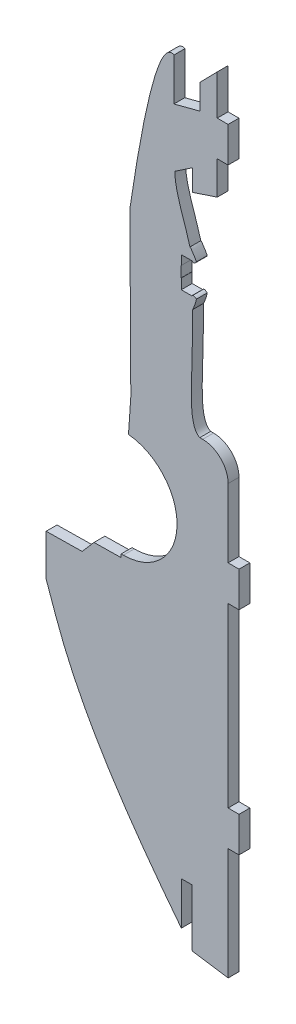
ISO-10303-21;
HEADER;
FILE_DESCRIPTION(('STEP AP214'),'2;1');
FILE_NAME('part.step','',(''),(''),'','','');
FILE_SCHEMA(('AUTOMOTIVE_DESIGN { 1 0 10303 214 1 1 1 1 }'));
ENDSEC;
DATA;
#1=APPLICATION_CONTEXT('core data for automotive mechanical design processes');
#2=APPLICATION_PROTOCOL_DEFINITION('international standard','automotive_design',2000,#1);
#3=PRODUCT_CONTEXT('',#1,'mechanical');
#4=PRODUCT('Part','Part','',(#3));
#5=PRODUCT_RELATED_PRODUCT_CATEGORY('part','',(#4));
#6=PRODUCT_DEFINITION_FORMATION('','',#4);
#7=PRODUCT_DEFINITION_CONTEXT('part definition',#1,'design');
#8=PRODUCT_DEFINITION('design','',#6,#7);
#9=PRODUCT_DEFINITION_SHAPE('','',#8);
#10=(LENGTH_UNIT() NAMED_UNIT(*) SI_UNIT(.MILLI.,.METRE.));
#11=(NAMED_UNIT(*) PLANE_ANGLE_UNIT() SI_UNIT($,.RADIAN.));
#12=(NAMED_UNIT(*) SI_UNIT($,.STERADIAN.) SOLID_ANGLE_UNIT());
#13=UNCERTAINTY_MEASURE_WITH_UNIT(LENGTH_MEASURE(1.E-05),#10,'distance_accuracy_value','');
#14=(GEOMETRIC_REPRESENTATION_CONTEXT(3) GLOBAL_UNCERTAINTY_ASSIGNED_CONTEXT((#13)) GLOBAL_UNIT_ASSIGNED_CONTEXT((#10,
#11,#12)) REPRESENTATION_CONTEXT('',''));
#15=CARTESIAN_POINT('',(0.,0.,0.));
#16=DIRECTION('',(0.,0.,1.));
#17=DIRECTION('',(1.,0.,0.));
#18=AXIS2_PLACEMENT_3D('',#15,#16,#17);
#19=CARTESIAN_POINT('',(762.503533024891,409.83860867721,3.));
#20=CARTESIAN_POINT('',(766.028554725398,399.92844700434,3.));
#21=CARTESIAN_POINT('',(771.045733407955,390.324812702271,3.));
#22=CARTESIAN_POINT('',(776.800205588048,381.106770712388,3.));
#23=B_SPLINE_CURVE_WITH_KNOTS('',3,(#19,#20,#21,#22),.UNSPECIFIED.,.F.,.F.,(4,4),(0.,1.),.UNSPECIFIED.);
#24=DIRECTION('',(0.,0.,-1.));
#25=VECTOR('',#24,1.);
#26=SURFACE_OF_LINEAR_EXTRUSION('',#23,#25);
#27=CARTESIAN_POINT('',(762.503533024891,409.83860867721,0.));
#28=CARTESIAN_POINT('',(766.028554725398,399.92844700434,0.));
#29=CARTESIAN_POINT('',(771.045733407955,390.324812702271,0.));
#30=CARTESIAN_POINT('',(776.800205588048,381.106770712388,0.));
#31=B_SPLINE_CURVE_WITH_KNOTS('',3,(#27,#28,#29,#30),.UNSPECIFIED.,.F.,.F.,(4,4),(0.,1.),.UNSPECIFIED.);
#32=CARTESIAN_POINT('',(762.503533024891,409.83860867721,0.));
#33=VERTEX_POINT('',#32);
#34=CARTESIAN_POINT('',(776.800205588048,381.106770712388,0.));
#35=VERTEX_POINT('',#34);
#36=EDGE_CURVE('E11',#33,#35,#31,.T.);
#37=ORIENTED_EDGE('',*,*,#36,.T.);
#38=DIRECTION('',(0.,0.,-1.));
#39=VECTOR('',#38,1.);
#40=CARTESIAN_POINT('',(776.800205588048,381.106770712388,3.));
#41=LINE('',#40,#39);
#42=CARTESIAN_POINT('',(776.800205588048,381.106770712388,3.));
#43=VERTEX_POINT('',#42);
#44=EDGE_CURVE('E2050',#43,#35,#41,.T.);
#45=ORIENTED_EDGE('',*,*,#44,.F.);
#46=CARTESIAN_POINT('',(762.503533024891,409.83860867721,3.));
#47=VERTEX_POINT('',#46);
#48=EDGE_CURVE('E47',#47,#43,#23,.T.);
#49=ORIENTED_EDGE('',*,*,#48,.F.);
#50=DIRECTION('',(0.,0.,-1.));
#51=VECTOR('',#50,1.);
#52=CARTESIAN_POINT('',(762.503533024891,409.83860867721,3.));
#53=LINE('',#52,#51);
#54=EDGE_CURVE('E492',#47,#33,#53,.T.);
#55=ORIENTED_EDGE('',*,*,#54,.T.);
#56=EDGE_LOOP('',(#37,#45,#49,#55));
#57=FACE_BOUND('',#56,.T.);
#58=ADVANCED_FACE('F44',(#57),#26,.F.);
#59=CARTESIAN_POINT('',(776.993819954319,380.797487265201,3.));
#60=DIRECTION('',(0.847613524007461,0.530614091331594,0.));
#61=DIRECTION('',(-0.530614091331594,0.847613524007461,0.));
#62=AXIS2_PLACEMENT_3D('',#59,#60,#61);
#63=PLANE('',#62);
#64=DIRECTION('',(0.530614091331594,-0.847613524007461,0.));
#65=VECTOR('',#64,1.);
#66=CARTESIAN_POINT('',(776.993819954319,380.797487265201,0.));
#67=LINE('',#66,#65);
#68=CARTESIAN_POINT('',(776.993819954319,380.797487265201,0.));
#69=VERTEX_POINT('',#68);
#70=EDGE_CURVE('E56',#35,#69,#67,.T.);
#71=ORIENTED_EDGE('',*,*,#70,.T.);
#72=DIRECTION('',(0.,0.,-1.));
#73=VECTOR('',#72,1.);
#74=CARTESIAN_POINT('',(776.993819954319,380.797487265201,3.));
#75=LINE('',#74,#73);
#76=CARTESIAN_POINT('',(776.993819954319,380.797487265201,3.));
#77=VERTEX_POINT('',#76);
#78=EDGE_CURVE('E454',#77,#69,#75,.T.);
#79=ORIENTED_EDGE('',*,*,#78,.F.);
#80=DIRECTION('',(0.530614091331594,-0.847613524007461,0.));
#81=VECTOR('',#80,1.);
#82=CARTESIAN_POINT('',(776.993819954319,380.797487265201,3.));
#83=LINE('',#82,#81);
#84=EDGE_CURVE('E260',#43,#77,#83,.T.);
#85=ORIENTED_EDGE('',*,*,#84,.F.);
#86=ORIENTED_EDGE('',*,*,#44,.T.);
#87=EDGE_LOOP('',(#71,#79,#85,#86));
#88=FACE_BOUND('',#87,.T.);
#89=ADVANCED_FACE('F560',(#88),#63,.F.);
#90=CARTESIAN_POINT('',(776.993819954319,380.797487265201,3.));
#91=CARTESIAN_POINT('',(783.171952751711,370.938226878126,3.));
#92=CARTESIAN_POINT('',(790.185736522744,361.522005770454,3.));
#93=CARTESIAN_POINT('',(797.118646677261,352.651143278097,3.));
#94=B_SPLINE_CURVE_WITH_KNOTS('',3,(#90,#91,#92,#93),.UNSPECIFIED.,.F.,.F.,(4,4),(64.,65.),.UNSPECIFIED.);
#95=DIRECTION('',(0.,0.,-1.));
#96=VECTOR('',#95,1.);
#97=SURFACE_OF_LINEAR_EXTRUSION('',#94,#96);
#98=CARTESIAN_POINT('',(776.993819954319,380.797487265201,0.));
#99=CARTESIAN_POINT('',(783.171952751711,370.938226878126,0.));
#100=CARTESIAN_POINT('',(790.185736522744,361.522005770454,0.));
#101=CARTESIAN_POINT('',(797.118646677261,352.651143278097,0.));
#102=B_SPLINE_CURVE_WITH_KNOTS('',3,(#98,#99,#100,#101),.UNSPECIFIED.,.F.,.F.,(4,4),(64.,65.),.UNSPECIFIED.);
#103=CARTESIAN_POINT('',(797.118646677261,352.651143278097,0.));
#104=VERTEX_POINT('',#103);
#105=EDGE_CURVE('E450',#69,#104,#102,.T.);
#106=ORIENTED_EDGE('',*,*,#105,.T.);
#107=DIRECTION('',(0.,0.,-1.));
#108=VECTOR('',#107,1.);
#109=CARTESIAN_POINT('',(797.118646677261,352.651143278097,3.));
#110=LINE('',#109,#108);
#111=CARTESIAN_POINT('',(797.118646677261,352.651143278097,3.));
#112=VERTEX_POINT('',#111);
#113=EDGE_CURVE('E451',#112,#104,#110,.T.);
#114=ORIENTED_EDGE('',*,*,#113,.F.);
#115=EDGE_CURVE('E569',#77,#112,#94,.T.);
#116=ORIENTED_EDGE('',*,*,#115,.F.);
#117=ORIENTED_EDGE('',*,*,#78,.T.);
#118=EDGE_LOOP('',(#106,#114,#116,#117));
#119=FACE_BOUND('',#118,.T.);
#120=ADVANCED_FACE('F446',(#119),#97,.F.);
#121=CARTESIAN_POINT('',(797.118646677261,364.479706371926,3.));
#122=DIRECTION('',(-1.,0.,0.));
#123=DIRECTION('',(0.,0.,1.));
#124=AXIS2_PLACEMENT_3D('',#121,#122,#123);
#125=PLANE('',#124);
#126=DIRECTION('',(0.,1.,0.));
#127=VECTOR('',#126,1.);
#128=CARTESIAN_POINT('',(797.118646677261,364.479706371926,0.));
#129=LINE('',#128,#127);
#130=CARTESIAN_POINT('',(797.118646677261,364.479706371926,0.));
#131=VERTEX_POINT('',#130);
#132=EDGE_CURVE('E457',#104,#131,#129,.T.);
#133=ORIENTED_EDGE('',*,*,#132,.T.);
#134=DIRECTION('',(0.,0.,-1.));
#135=VECTOR('',#134,1.);
#136=CARTESIAN_POINT('',(797.118646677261,364.479706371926,3.));
#137=LINE('',#136,#135);
#138=CARTESIAN_POINT('',(797.118646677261,364.479706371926,3.));
#139=VERTEX_POINT('',#138);
#140=EDGE_CURVE('E461',#139,#131,#137,.T.);
#141=ORIENTED_EDGE('',*,*,#140,.F.);
#142=DIRECTION('',(0.,1.,0.));
#143=VECTOR('',#142,1.);
#144=CARTESIAN_POINT('',(797.118646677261,364.479706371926,3.));
#145=LINE('',#144,#143);
#146=EDGE_CURVE('E465',#112,#139,#145,.T.);
#147=ORIENTED_EDGE('',*,*,#146,.F.);
#148=ORIENTED_EDGE('',*,*,#113,.T.);
#149=EDGE_LOOP('',(#133,#141,#147,#148));
#150=FACE_BOUND('',#149,.T.);
#151=ADVANCED_FACE('F459',(#150),#125,.F.);
#152=CARTESIAN_POINT('',(800.118635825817,364.479706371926,3.));
#153=DIRECTION('',(0.,1.,0.));
#154=DIRECTION('',(0.,0.,1.));
#155=AXIS2_PLACEMENT_3D('',#152,#153,#154);
#156=PLANE('',#155);
#157=DIRECTION('',(1.,0.,0.));
#158=VECTOR('',#157,1.);
#159=CARTESIAN_POINT('',(800.118635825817,364.479706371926,0.));
#160=LINE('',#159,#158);
#161=CARTESIAN_POINT('',(800.118635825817,364.479706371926,0.));
#162=VERTEX_POINT('',#161);
#163=EDGE_CURVE('E468',#131,#162,#160,.T.);
#164=ORIENTED_EDGE('',*,*,#163,.T.);
#165=DIRECTION('',(0.,0.,-1.));
#166=VECTOR('',#165,1.);
#167=CARTESIAN_POINT('',(800.118635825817,364.479706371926,3.));
#168=LINE('',#167,#166);
#169=CARTESIAN_POINT('',(800.118635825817,364.479706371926,3.));
#170=VERTEX_POINT('',#169);
#171=EDGE_CURVE('E844',#170,#162,#168,.T.);
#172=ORIENTED_EDGE('',*,*,#171,.F.);
#173=DIRECTION('',(1.,0.,0.));
#174=VECTOR('',#173,1.);
#175=CARTESIAN_POINT('',(800.118635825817,364.479706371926,3.));
#176=LINE('',#175,#174);
#177=EDGE_CURVE('E1962',#139,#170,#176,.T.);
#178=ORIENTED_EDGE('',*,*,#177,.F.);
#179=ORIENTED_EDGE('',*,*,#140,.T.);
#180=EDGE_LOOP('',(#164,#172,#178,#179));
#181=FACE_BOUND('',#180,.T.);
#182=ADVANCED_FACE('F1828',(#181),#156,.F.);
#183=CARTESIAN_POINT('',(800.118635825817,348.831996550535,3.));
#184=DIRECTION('',(1.,0.,0.));
#185=DIRECTION('',(0.,0.,-1.));
#186=AXIS2_PLACEMENT_3D('',#183,#184,#185);
#187=PLANE('',#186);
#188=DIRECTION('',(0.,-1.,0.));
#189=VECTOR('',#188,1.);
#190=CARTESIAN_POINT('',(800.118635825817,348.831996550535,0.));
#191=LINE('',#190,#189);
#192=CARTESIAN_POINT('',(800.118635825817,348.831996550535,0.));
#193=VERTEX_POINT('',#192);
#194=EDGE_CURVE('E471',#162,#193,#191,.T.);
#195=ORIENTED_EDGE('',*,*,#194,.T.);
#196=DIRECTION('',(0.,0.,-1.));
#197=VECTOR('',#196,1.);
#198=CARTESIAN_POINT('',(800.118635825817,348.831996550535,3.));
#199=LINE('',#198,#197);
#200=CARTESIAN_POINT('',(800.118635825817,348.831996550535,3.));
#201=VERTEX_POINT('',#200);
#202=EDGE_CURVE('E842',#201,#193,#199,.T.);
#203=ORIENTED_EDGE('',*,*,#202,.F.);
#204=DIRECTION('',(0.,-1.,0.));
#205=VECTOR('',#204,1.);
#206=CARTESIAN_POINT('',(800.118635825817,348.831996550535,3.));
#207=LINE('',#206,#205);
#208=EDGE_CURVE('E1961',#170,#201,#207,.T.);
#209=ORIENTED_EDGE('',*,*,#208,.F.);
#210=ORIENTED_EDGE('',*,*,#171,.T.);
#211=EDGE_LOOP('',(#195,#203,#209,#210));
#212=FACE_BOUND('',#211,.T.);
#213=ADVANCED_FACE('F838',(#212),#187,.F.);
#214=CARTESIAN_POINT('',(800.250152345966,348.665167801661,3.));
#215=DIRECTION('',(0.785318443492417,0.619092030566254,0.));
#216=DIRECTION('',(-0.619092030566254,0.785318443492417,0.));
#217=AXIS2_PLACEMENT_3D('',#214,#215,#216);
#218=PLANE('',#217);
#219=DIRECTION('',(0.619092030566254,-0.785318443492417,0.));
#220=VECTOR('',#219,1.);
#221=CARTESIAN_POINT('',(800.250152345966,348.665167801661,0.));
#222=LINE('',#221,#220);
#223=CARTESIAN_POINT('',(800.250152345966,348.665167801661,0.));
#224=VERTEX_POINT('',#223);
#225=EDGE_CURVE('E835',#193,#224,#222,.T.);
#226=ORIENTED_EDGE('',*,*,#225,.T.);
#227=DIRECTION('',(0.,0.,-1.));
#228=VECTOR('',#227,1.);
#229=CARTESIAN_POINT('',(800.250152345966,348.665167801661,3.));
#230=LINE('',#229,#228);
#231=CARTESIAN_POINT('',(800.250152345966,348.665167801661,3.));
#232=VERTEX_POINT('',#231);
#233=EDGE_CURVE('E852',#232,#224,#230,.T.);
#234=ORIENTED_EDGE('',*,*,#233,.F.);
#235=DIRECTION('',(0.619092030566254,-0.785318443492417,0.));
#236=VECTOR('',#235,1.);
#237=CARTESIAN_POINT('',(800.250152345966,348.665167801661,3.));
#238=LINE('',#237,#236);
#239=EDGE_CURVE('E848',#201,#232,#238,.T.);
#240=ORIENTED_EDGE('',*,*,#239,.F.);
#241=ORIENTED_EDGE('',*,*,#202,.T.);
#242=EDGE_LOOP('',(#226,#234,#240,#241));
#243=FACE_BOUND('',#242,.T.);
#244=ADVANCED_FACE('F850',(#243),#218,.F.);
#245=CARTESIAN_POINT('',(810.026041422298,347.188169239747,3.));
#246=DIRECTION('',(0.149390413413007,0.988778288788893,0.));
#247=DIRECTION('',(-0.988778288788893,0.149390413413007,0.));
#248=AXIS2_PLACEMENT_3D('',#245,#246,#247);
#249=PLANE('',#248);
#250=DIRECTION('',(0.988778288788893,-0.149390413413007,0.));
#251=VECTOR('',#250,1.);
#252=CARTESIAN_POINT('',(810.026041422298,347.188169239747,0.));
#253=LINE('',#252,#251);
#254=CARTESIAN_POINT('',(810.026041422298,347.188169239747,0.));
#255=VERTEX_POINT('',#254);
#256=EDGE_CURVE('E826',#224,#255,#253,.T.);
#257=ORIENTED_EDGE('',*,*,#256,.T.);
#258=DIRECTION('',(0.,0.,-1.));
#259=VECTOR('',#258,1.);
#260=CARTESIAN_POINT('',(810.026041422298,347.188169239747,3.));
#261=LINE('',#260,#259);
#262=CARTESIAN_POINT('',(810.026041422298,347.188169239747,3.));
#263=VERTEX_POINT('',#262);
#264=EDGE_CURVE('E865',#263,#255,#261,.T.);
#265=ORIENTED_EDGE('',*,*,#264,.F.);
#266=DIRECTION('',(0.988778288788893,-0.149390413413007,0.));
#267=VECTOR('',#266,1.);
#268=CARTESIAN_POINT('',(810.026041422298,347.188169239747,3.));
#269=LINE('',#268,#267);
#270=EDGE_CURVE('E1956',#232,#263,#269,.T.);
#271=ORIENTED_EDGE('',*,*,#270,.F.);
#272=ORIENTED_EDGE('',*,*,#233,.T.);
#273=EDGE_LOOP('',(#257,#265,#271,#272));
#274=FACE_BOUND('',#273,.T.);
#275=ADVANCED_FACE('F859',(#274),#249,.F.);
#276=CARTESIAN_POINT('',(810.026041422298,378.114963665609,3.));
#277=DIRECTION('',(-1.,0.,0.));
#278=DIRECTION('',(0.,0.,1.));
#279=AXIS2_PLACEMENT_3D('',#276,#277,#278);
#280=PLANE('',#279);
#281=DIRECTION('',(0.,1.,0.));
#282=VECTOR('',#281,1.);
#283=CARTESIAN_POINT('',(810.026041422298,378.114963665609,0.));
#284=LINE('',#283,#282);
#285=CARTESIAN_POINT('',(810.026041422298,378.114963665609,0.));
#286=VERTEX_POINT('',#285);
#287=EDGE_CURVE('E827',#255,#286,#284,.T.);
#288=ORIENTED_EDGE('',*,*,#287,.T.);
#289=DIRECTION('',(0.,0.,-1.));
#290=VECTOR('',#289,1.);
#291=CARTESIAN_POINT('',(810.026041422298,378.114963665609,3.));
#292=LINE('',#291,#290);
#293=CARTESIAN_POINT('',(810.026041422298,378.114963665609,3.));
#294=VERTEX_POINT('',#293);
#295=EDGE_CURVE('E869',#294,#286,#292,.T.);
#296=ORIENTED_EDGE('',*,*,#295,.F.);
#297=DIRECTION('',(0.,1.,0.));
#298=VECTOR('',#297,1.);
#299=CARTESIAN_POINT('',(810.026041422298,378.114963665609,3.));
#300=LINE('',#299,#298);
#301=EDGE_CURVE('E868',#263,#294,#300,.T.);
#302=ORIENTED_EDGE('',*,*,#301,.F.);
#303=ORIENTED_EDGE('',*,*,#264,.T.);
#304=EDGE_LOOP('',(#288,#296,#302,#303));
#305=FACE_BOUND('',#304,.T.);
#306=ADVANCED_FACE('F862',(#305),#280,.F.);
#307=CARTESIAN_POINT('',(813.03455718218,378.114963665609,3.));
#308=DIRECTION('',(0.,1.,0.));
#309=DIRECTION('',(0.,0.,1.));
#310=AXIS2_PLACEMENT_3D('',#307,#308,#309);
#311=PLANE('',#310);
#312=DIRECTION('',(1.,0.,0.));
#313=VECTOR('',#312,1.);
#314=CARTESIAN_POINT('',(813.03455718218,378.114963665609,0.));
#315=LINE('',#314,#313);
#316=CARTESIAN_POINT('',(813.03455718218,378.114963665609,0.));
#317=VERTEX_POINT('',#316);
#318=EDGE_CURVE('E822',#286,#317,#315,.T.);
#319=ORIENTED_EDGE('',*,*,#318,.T.);
#320=DIRECTION('',(0.,0.,-1.));
#321=VECTOR('',#320,1.);
#322=CARTESIAN_POINT('',(813.03455718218,378.114963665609,3.));
#323=LINE('',#322,#321);
#324=CARTESIAN_POINT('',(813.03455718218,378.114963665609,3.));
#325=VERTEX_POINT('',#324);
#326=EDGE_CURVE('E872',#325,#317,#323,.T.);
#327=ORIENTED_EDGE('',*,*,#326,.F.);
#328=DIRECTION('',(1.,0.,0.));
#329=VECTOR('',#328,1.);
#330=CARTESIAN_POINT('',(813.03455718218,378.114963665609,3.));
#331=LINE('',#330,#329);
#332=EDGE_CURVE('E1954',#294,#325,#331,.T.);
#333=ORIENTED_EDGE('',*,*,#332,.F.);
#334=ORIENTED_EDGE('',*,*,#295,.T.);
#335=EDGE_LOOP('',(#319,#327,#333,#334));
#336=FACE_BOUND('',#335,.T.);
#337=ADVANCED_FACE('F1793',(#336),#311,.F.);
#338=CARTESIAN_POINT('',(813.03455718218,387.831597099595,3.));
#339=DIRECTION('',(-1.,0.,0.));
#340=DIRECTION('',(0.,0.,1.));
#341=AXIS2_PLACEMENT_3D('',#338,#339,#340);
#342=PLANE('',#341);
#343=DIRECTION('',(0.,1.,0.));
#344=VECTOR('',#343,1.);
#345=CARTESIAN_POINT('',(813.03455718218,387.831597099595,0.));
#346=LINE('',#345,#344);
#347=CARTESIAN_POINT('',(813.03455718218,387.831597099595,0.));
#348=VERTEX_POINT('',#347);
#349=EDGE_CURVE('E819',#317,#348,#346,.T.);
#350=ORIENTED_EDGE('',*,*,#349,.T.);
#351=DIRECTION('',(0.,0.,-1.));
#352=VECTOR('',#351,1.);
#353=CARTESIAN_POINT('',(813.03455718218,387.831597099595,3.));
#354=LINE('',#353,#352);
#355=CARTESIAN_POINT('',(813.03455718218,387.831597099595,3.));
#356=VERTEX_POINT('',#355);
#357=EDGE_CURVE('E882',#356,#348,#354,.T.);
#358=ORIENTED_EDGE('',*,*,#357,.F.);
#359=DIRECTION('',(0.,1.,0.));
#360=VECTOR('',#359,1.);
#361=CARTESIAN_POINT('',(813.03455718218,387.831597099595,3.));
#362=LINE('',#361,#360);
#363=EDGE_CURVE('E1948',#325,#356,#362,.T.);
#364=ORIENTED_EDGE('',*,*,#363,.F.);
#365=ORIENTED_EDGE('',*,*,#326,.T.);
#366=EDGE_LOOP('',(#350,#358,#364,#365));
#367=FACE_BOUND('',#366,.T.);
#368=ADVANCED_FACE('F1785',(#367),#342,.F.);
#369=CARTESIAN_POINT('',(810.026041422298,387.831597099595,3.));
#370=DIRECTION('',(0.,-1.,0.));
#371=DIRECTION('',(0.,0.,-1.));
#372=AXIS2_PLACEMENT_3D('',#369,#370,#371);
#373=PLANE('',#372);
#374=DIRECTION('',(-1.,0.,0.));
#375=VECTOR('',#374,1.);
#376=CARTESIAN_POINT('',(810.026041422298,387.831597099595,0.));
#377=LINE('',#376,#375);
#378=CARTESIAN_POINT('',(810.026041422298,387.831597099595,0.));
#379=VERTEX_POINT('',#378);
#380=EDGE_CURVE('E816',#348,#379,#377,.T.);
#381=ORIENTED_EDGE('',*,*,#380,.T.);
#382=DIRECTION('',(0.,0.,-1.));
#383=VECTOR('',#382,1.);
#384=CARTESIAN_POINT('',(810.026041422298,387.831597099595,3.));
#385=LINE('',#384,#383);
#386=CARTESIAN_POINT('',(810.026041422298,387.831597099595,3.));
#387=VERTEX_POINT('',#386);
#388=EDGE_CURVE('E883',#387,#379,#385,.T.);
#389=ORIENTED_EDGE('',*,*,#388,.F.);
#390=DIRECTION('',(-1.,0.,0.));
#391=VECTOR('',#390,1.);
#392=CARTESIAN_POINT('',(810.026041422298,387.831597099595,3.));
#393=LINE('',#392,#391);
#394=EDGE_CURVE('E1950',#356,#387,#393,.T.);
#395=ORIENTED_EDGE('',*,*,#394,.F.);
#396=ORIENTED_EDGE('',*,*,#357,.T.);
#397=EDGE_LOOP('',(#381,#389,#395,#396));
#398=FACE_BOUND('',#397,.T.);
#399=ADVANCED_FACE('F1772',(#398),#373,.F.);
#400=CARTESIAN_POINT('',(810.026041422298,436.722066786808,3.));
#401=DIRECTION('',(-1.,0.,0.));
#402=DIRECTION('',(0.,0.,1.));
#403=AXIS2_PLACEMENT_3D('',#400,#401,#402);
#404=PLANE('',#403);
#405=DIRECTION('',(0.,1.,0.));
#406=VECTOR('',#405,1.);
#407=CARTESIAN_POINT('',(810.026041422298,436.722066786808,0.));
#408=LINE('',#407,#406);
#409=CARTESIAN_POINT('',(810.026041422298,436.722066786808,0.));
#410=VERTEX_POINT('',#409);
#411=EDGE_CURVE('E813',#379,#410,#408,.T.);
#412=ORIENTED_EDGE('',*,*,#411,.T.);
#413=DIRECTION('',(0.,0.,-1.));
#414=VECTOR('',#413,1.);
#415=CARTESIAN_POINT('',(810.026041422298,436.722066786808,3.));
#416=LINE('',#415,#414);
#417=CARTESIAN_POINT('',(810.026041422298,436.722066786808,3.));
#418=VERTEX_POINT('',#417);
#419=EDGE_CURVE('E886',#418,#410,#416,.T.);
#420=ORIENTED_EDGE('',*,*,#419,.F.);
#421=DIRECTION('',(0.,1.,0.));
#422=VECTOR('',#421,1.);
#423=CARTESIAN_POINT('',(810.026041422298,398.217440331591,3.));
#424=LINE('',#423,#422);
#425=EDGE_CURVE('E1944',#387,#418,#424,.T.);
#426=ORIENTED_EDGE('',*,*,#425,.F.);
#427=ORIENTED_EDGE('',*,*,#388,.T.);
#428=EDGE_LOOP('',(#412,#420,#426,#427));
#429=FACE_BOUND('',#428,.T.);
#430=ADVANCED_FACE('F1765',(#429),#404,.F.);
#431=CARTESIAN_POINT('',(813.03455718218,436.722066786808,3.));
#432=DIRECTION('',(0.,1.,0.));
#433=DIRECTION('',(0.,0.,1.));
#434=AXIS2_PLACEMENT_3D('',#431,#432,#433);
#435=PLANE('',#434);
#436=DIRECTION('',(1.,0.,0.));
#437=VECTOR('',#436,1.);
#438=CARTESIAN_POINT('',(813.03455718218,436.722066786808,0.));
#439=LINE('',#438,#437);
#440=CARTESIAN_POINT('',(813.03455718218,436.722066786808,0.));
#441=VERTEX_POINT('',#440);
#442=EDGE_CURVE('E807',#410,#441,#439,.T.);
#443=ORIENTED_EDGE('',*,*,#442,.T.);
#444=DIRECTION('',(0.,0.,-1.));
#445=VECTOR('',#444,1.);
#446=CARTESIAN_POINT('',(813.03455718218,436.722066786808,3.));
#447=LINE('',#446,#445);
#448=CARTESIAN_POINT('',(813.03455718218,436.722066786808,3.));
#449=VERTEX_POINT('',#448);
#450=EDGE_CURVE('E894',#449,#441,#447,.T.);
#451=ORIENTED_EDGE('',*,*,#450,.F.);
#452=DIRECTION('',(1.,0.,0.));
#453=VECTOR('',#452,1.);
#454=CARTESIAN_POINT('',(813.03455718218,436.722066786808,3.));
#455=LINE('',#454,#453);
#456=EDGE_CURVE('E1942',#418,#449,#455,.T.);
#457=ORIENTED_EDGE('',*,*,#456,.F.);
#458=ORIENTED_EDGE('',*,*,#419,.T.);
#459=EDGE_LOOP('',(#443,#451,#457,#458));
#460=FACE_BOUND('',#459,.T.);
#461=ADVANCED_FACE('F1753',(#460),#435,.F.);
#462=CARTESIAN_POINT('',(813.03455718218,446.438700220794,3.));
#463=DIRECTION('',(-1.,0.,0.));
#464=DIRECTION('',(0.,0.,1.));
#465=AXIS2_PLACEMENT_3D('',#462,#463,#464);
#466=PLANE('',#465);
#467=DIRECTION('',(0.,1.,0.));
#468=VECTOR('',#467,1.);
#469=CARTESIAN_POINT('',(813.03455718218,446.438700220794,0.));
#470=LINE('',#469,#468);
#471=CARTESIAN_POINT('',(813.03455718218,446.438700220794,0.));
#472=VERTEX_POINT('',#471);
#473=EDGE_CURVE('E810',#441,#472,#470,.T.);
#474=ORIENTED_EDGE('',*,*,#473,.T.);
#475=DIRECTION('',(0.,0.,-1.));
#476=VECTOR('',#475,1.);
#477=CARTESIAN_POINT('',(813.03455718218,446.438700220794,3.));
#478=LINE('',#477,#476);
#479=CARTESIAN_POINT('',(813.03455718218,446.438700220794,3.));
#480=VERTEX_POINT('',#479);
#481=EDGE_CURVE('E900',#480,#472,#478,.T.);
#482=ORIENTED_EDGE('',*,*,#481,.F.);
#483=DIRECTION('',(0.,1.,0.));
#484=VECTOR('',#483,1.);
#485=CARTESIAN_POINT('',(813.03455718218,446.438700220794,3.));
#486=LINE('',#485,#484);
#487=EDGE_CURVE('E1939',#449,#480,#486,.T.);
#488=ORIENTED_EDGE('',*,*,#487,.F.);
#489=ORIENTED_EDGE('',*,*,#450,.T.);
#490=EDGE_LOOP('',(#474,#482,#488,#489));
#491=FACE_BOUND('',#490,.T.);
#492=ADVANCED_FACE('F1744',(#491),#466,.F.);
#493=CARTESIAN_POINT('',(810.026041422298,446.438700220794,3.));
#494=DIRECTION('',(0.,-1.,0.));
#495=DIRECTION('',(0.,0.,-1.));
#496=AXIS2_PLACEMENT_3D('',#493,#494,#495);
#497=PLANE('',#496);
#498=DIRECTION('',(-1.,0.,0.));
#499=VECTOR('',#498,1.);
#500=CARTESIAN_POINT('',(810.026041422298,446.438700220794,0.));
#501=LINE('',#500,#499);
#502=CARTESIAN_POINT('',(810.026041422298,446.438700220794,0.));
#503=VERTEX_POINT('',#502);
#504=EDGE_CURVE('E805',#472,#503,#501,.T.);
#505=ORIENTED_EDGE('',*,*,#504,.T.);
#506=DIRECTION('',(0.,0.,-1.));
#507=VECTOR('',#506,1.);
#508=CARTESIAN_POINT('',(810.026041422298,446.438700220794,3.));
#509=LINE('',#508,#507);
#510=CARTESIAN_POINT('',(810.026041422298,446.438700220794,3.));
#511=VERTEX_POINT('',#510);
#512=EDGE_CURVE('E902',#511,#503,#509,.T.);
#513=ORIENTED_EDGE('',*,*,#512,.F.);
#514=DIRECTION('',(-1.,0.,0.));
#515=VECTOR('',#514,1.);
#516=CARTESIAN_POINT('',(810.026041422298,446.438700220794,3.));
#517=LINE('',#516,#515);
#518=EDGE_CURVE('E1933',#480,#511,#517,.T.);
#519=ORIENTED_EDGE('',*,*,#518,.F.);
#520=ORIENTED_EDGE('',*,*,#481,.T.);
#521=EDGE_LOOP('',(#505,#513,#519,#520));
#522=FACE_BOUND('',#521,.T.);
#523=ADVANCED_FACE('F1735',(#522),#497,.F.);
#524=CARTESIAN_POINT('',(810.026041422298,465.399644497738,3.));
#525=DIRECTION('',(-1.,0.,0.));
#526=DIRECTION('',(0.,0.,1.));
#527=AXIS2_PLACEMENT_3D('',#524,#525,#526);
#528=PLANE('',#527);
#529=DIRECTION('',(0.,1.,0.));
#530=VECTOR('',#529,1.);
#531=CARTESIAN_POINT('',(810.026041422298,465.399644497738,0.));
#532=LINE('',#531,#530);
#533=CARTESIAN_POINT('',(810.026041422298,465.399644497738,0.));
#534=VERTEX_POINT('',#533);
#535=EDGE_CURVE('E799',#503,#534,#532,.T.);
#536=ORIENTED_EDGE('',*,*,#535,.T.);
#537=DIRECTION('',(0.,0.,-1.));
#538=VECTOR('',#537,1.);
#539=CARTESIAN_POINT('',(810.026041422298,465.399644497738,3.));
#540=LINE('',#539,#538);
#541=CARTESIAN_POINT('',(810.026041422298,465.399644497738,3.));
#542=VERTEX_POINT('',#541);
#543=EDGE_CURVE('E903',#542,#534,#540,.T.);
#544=ORIENTED_EDGE('',*,*,#543,.F.);
#545=DIRECTION('',(0.,1.,0.));
#546=VECTOR('',#545,1.);
#547=CARTESIAN_POINT('',(810.026041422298,465.399644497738,3.));
#548=LINE('',#547,#546);
#549=EDGE_CURVE('E1930',#511,#542,#548,.T.);
#550=ORIENTED_EDGE('',*,*,#549,.F.);
#551=ORIENTED_EDGE('',*,*,#512,.T.);
#552=EDGE_LOOP('',(#536,#544,#550,#551));
#553=FACE_BOUND('',#552,.T.);
#554=ADVANCED_FACE('F1727',(#553),#528,.F.);
#555=CARTESIAN_POINT('',(810.026041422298,465.399644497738,3.));
#556=CARTESIAN_POINT('',(810.026041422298,469.285970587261,3.));
#557=CARTESIAN_POINT('',(806.886439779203,472.44228094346,3.));
#558=CARTESIAN_POINT('',(803.00011368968,472.462951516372,3.));
#559=B_SPLINE_CURVE_WITH_KNOTS('',3,(#555,#556,#557,#558),.UNSPECIFIED.,.F.,.F.,(4,4),(47.,48.),.UNSPECIFIED.);
#560=DIRECTION('',(0.,0.,-1.));
#561=VECTOR('',#560,1.);
#562=SURFACE_OF_LINEAR_EXTRUSION('',#559,#561);
#563=CARTESIAN_POINT('',(810.026041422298,465.399644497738,0.));
#564=CARTESIAN_POINT('',(810.026041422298,469.285970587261,0.));
#565=CARTESIAN_POINT('',(806.886439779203,472.44228094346,0.));
#566=CARTESIAN_POINT('',(803.00011368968,472.462951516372,0.));
#567=B_SPLINE_CURVE_WITH_KNOTS('',3,(#563,#564,#565,#566),.UNSPECIFIED.,.F.,.F.,(4,4),(47.,48.),.UNSPECIFIED.);
#568=CARTESIAN_POINT('',(803.00011368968,472.462951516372,0.));
#569=VERTEX_POINT('',#568);
#570=EDGE_CURVE('E794',#534,#569,#567,.T.);
#571=ORIENTED_EDGE('',*,*,#570,.T.);
#572=DIRECTION('',(0.,0.,-1.));
#573=VECTOR('',#572,1.);
#574=CARTESIAN_POINT('',(803.00011368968,472.462951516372,3.));
#575=LINE('',#574,#573);
#576=CARTESIAN_POINT('',(803.00011368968,472.462951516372,3.));
#577=VERTEX_POINT('',#576);
#578=EDGE_CURVE('E908',#577,#569,#575,.T.);
#579=ORIENTED_EDGE('',*,*,#578,.F.);
#580=EDGE_CURVE('E1919',#542,#577,#559,.T.);
#581=ORIENTED_EDGE('',*,*,#580,.F.);
#582=ORIENTED_EDGE('',*,*,#543,.T.);
#583=EDGE_LOOP('',(#571,#579,#581,#582));
#584=FACE_BOUND('',#583,.T.);
#585=ADVANCED_FACE('F1717',(#584),#562,.F.);
#586=CARTESIAN_POINT('',(802.208603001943,472.467171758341,3.));
#587=DIRECTION('',(-0.00533180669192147,-0.999985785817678,0.));
#588=DIRECTION('',(0.999985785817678,-0.00533180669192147,0.));
#589=AXIS2_PLACEMENT_3D('',#586,#587,#588);
#590=PLANE('',#589);
#591=DIRECTION('',(-0.999985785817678,0.00533180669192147,0.));
#592=VECTOR('',#591,1.);
#593=CARTESIAN_POINT('',(802.208603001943,472.467171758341,0.));
#594=LINE('',#593,#592);
#595=CARTESIAN_POINT('',(802.208603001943,472.467171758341,0.));
#596=VERTEX_POINT('',#595);
#597=EDGE_CURVE('E790',#569,#596,#594,.T.);
#598=ORIENTED_EDGE('',*,*,#597,.T.);
#599=DIRECTION('',(0.,0.,-1.));
#600=VECTOR('',#599,1.);
#601=CARTESIAN_POINT('',(802.208603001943,472.467171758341,3.));
#602=LINE('',#601,#600);
#603=CARTESIAN_POINT('',(802.208603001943,472.467171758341,3.));
#604=VERTEX_POINT('',#603);
#605=EDGE_CURVE('E911',#604,#596,#602,.T.);
#606=ORIENTED_EDGE('',*,*,#605,.F.);
#607=DIRECTION('',(-0.999985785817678,0.00533180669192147,0.));
#608=VECTOR('',#607,1.);
#609=CARTESIAN_POINT('',(802.208603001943,472.467171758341,3.));
#610=LINE('',#609,#608);
#611=EDGE_CURVE('E1929',#577,#604,#610,.T.);
#612=ORIENTED_EDGE('',*,*,#611,.F.);
#613=ORIENTED_EDGE('',*,*,#578,.T.);
#614=EDGE_LOOP('',(#598,#606,#612,#613));
#615=FACE_BOUND('',#614,.T.);
#616=ADVANCED_FACE('F1709',(#615),#590,.F.);
#617=CARTESIAN_POINT('',(802.208603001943,472.467171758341,3.));
#618=CARTESIAN_POINT('',(798.362153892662,474.263358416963,3.));
#619=CARTESIAN_POINT('',(800.493031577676,487.109258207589,3.));
#620=CARTESIAN_POINT('',(800.192360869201,502.07905936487,3.));
#621=B_SPLINE_CURVE_WITH_KNOTS('',3,(#617,#618,#619,#620),.UNSPECIFIED.,.F.,.F.,(4,4),(45.,46.),.UNSPECIFIED.);
#622=DIRECTION('',(0.,0.,-1.));
#623=VECTOR('',#622,1.);
#624=SURFACE_OF_LINEAR_EXTRUSION('',#621,#623);
#625=CARTESIAN_POINT('',(802.208603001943,472.467171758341,0.));
#626=CARTESIAN_POINT('',(798.362153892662,474.263358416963,0.));
#627=CARTESIAN_POINT('',(800.493031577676,487.109258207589,0.));
#628=CARTESIAN_POINT('',(800.192360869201,502.07905936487,0.));
#629=B_SPLINE_CURVE_WITH_KNOTS('',3,(#625,#626,#627,#628),.UNSPECIFIED.,.F.,.F.,(4,4),(45.,46.),.UNSPECIFIED.);
#630=CARTESIAN_POINT('',(800.192360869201,502.07905936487,0.));
#631=VERTEX_POINT('',#630);
#632=EDGE_CURVE('E776',#596,#631,#629,.T.);
#633=ORIENTED_EDGE('',*,*,#632,.T.);
#634=DIRECTION('',(0.,0.,-1.));
#635=VECTOR('',#634,1.);
#636=CARTESIAN_POINT('',(800.192360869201,502.07905936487,3.));
#637=LINE('',#636,#635);
#638=CARTESIAN_POINT('',(800.192360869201,502.07905936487,3.));
#639=VERTEX_POINT('',#638);
#640=EDGE_CURVE('E920',#639,#631,#637,.T.);
#641=ORIENTED_EDGE('',*,*,#640,.F.);
#642=EDGE_CURVE('E2004',#604,#639,#621,.T.);
#643=ORIENTED_EDGE('',*,*,#642,.F.);
#644=ORIENTED_EDGE('',*,*,#605,.T.);
#645=EDGE_LOOP('',(#633,#641,#643,#644));
#646=FACE_BOUND('',#645,.T.);
#647=ADVANCED_FACE('F1697',(#646),#624,.F.);
#648=CARTESIAN_POINT('',(800.192360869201,502.07905936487,3.));
#649=CARTESIAN_POINT('',(800.200284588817,502.069326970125,3.));
#650=CARTESIAN_POINT('',(800.20829443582,502.059594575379,3.));
#651=CARTESIAN_POINT('',(800.217510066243,502.062350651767,3.));
#652=B_SPLINE_CURVE_WITH_KNOTS('',3,(#648,#649,#650,#651),.UNSPECIFIED.,.F.,.F.,(4,4),(44.,45.),.UNSPECIFIED.);
#653=DIRECTION('',(0.,0.,-1.));
#654=VECTOR('',#653,1.);
#655=SURFACE_OF_LINEAR_EXTRUSION('',#652,#654);
#656=CARTESIAN_POINT('',(800.192360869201,502.07905936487,0.));
#657=CARTESIAN_POINT('',(800.200284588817,502.069326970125,0.));
#658=CARTESIAN_POINT('',(800.20829443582,502.059594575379,0.));
#659=CARTESIAN_POINT('',(800.217510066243,502.062350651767,0.));
#660=B_SPLINE_CURVE_WITH_KNOTS('',3,(#656,#657,#658,#659),.UNSPECIFIED.,.F.,.F.,(4,4),(44.,45.),.UNSPECIFIED.);
#661=CARTESIAN_POINT('',(800.217510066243,502.062350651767,0.));
#662=VERTEX_POINT('',#661);
#663=EDGE_CURVE('E772',#631,#662,#660,.T.);
#664=ORIENTED_EDGE('',*,*,#663,.T.);
#665=DIRECTION('',(0.,0.,-1.));
#666=VECTOR('',#665,1.);
#667=CARTESIAN_POINT('',(800.217510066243,502.062350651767,3.));
#668=LINE('',#667,#666);
#669=CARTESIAN_POINT('',(800.217510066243,502.062350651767,3.));
#670=VERTEX_POINT('',#669);
#671=EDGE_CURVE('E921',#670,#662,#668,.T.);
#672=ORIENTED_EDGE('',*,*,#671,.F.);
#673=EDGE_CURVE('E2003',#639,#670,#652,.T.);
#674=ORIENTED_EDGE('',*,*,#673,.F.);
#675=ORIENTED_EDGE('',*,*,#640,.T.);
#676=EDGE_LOOP('',(#664,#672,#674,#675));
#677=FACE_BOUND('',#676,.T.);
#678=ADVANCED_FACE('F1691',(#677),#655,.F.);
#679=CARTESIAN_POINT('',(800.217510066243,502.062350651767,3.));
#680=CARTESIAN_POINT('',(800.412846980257,502.12108952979,3.));
#681=CARTESIAN_POINT('',(801.32786434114,504.895338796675,3.));
#682=CARTESIAN_POINT('',(801.269125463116,505.090675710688,3.));
#683=B_SPLINE_CURVE_WITH_KNOTS('',3,(#679,#680,#681,#682),.UNSPECIFIED.,.F.,.F.,(4,4),(43.,44.),.UNSPECIFIED.);
#684=DIRECTION('',(0.,0.,-1.));
#685=VECTOR('',#684,1.);
#686=SURFACE_OF_LINEAR_EXTRUSION('',#683,#685);
#687=CARTESIAN_POINT('',(800.217510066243,502.062350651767,0.));
#688=CARTESIAN_POINT('',(800.412846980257,502.12108952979,0.));
#689=CARTESIAN_POINT('',(801.32786434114,504.895338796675,0.));
#690=CARTESIAN_POINT('',(801.269125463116,505.090675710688,0.));
#691=B_SPLINE_CURVE_WITH_KNOTS('',3,(#687,#688,#689,#690),.UNSPECIFIED.,.F.,.F.,(4,4),(43.,44.),.UNSPECIFIED.);
#692=CARTESIAN_POINT('',(801.269125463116,505.090675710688,0.));
#693=VERTEX_POINT('',#692);
#694=EDGE_CURVE('E763',#662,#693,#691,.T.);
#695=ORIENTED_EDGE('',*,*,#694,.T.);
#696=DIRECTION('',(0.,0.,-1.));
#697=VECTOR('',#696,1.);
#698=CARTESIAN_POINT('',(801.269125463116,505.090675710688,3.));
#699=LINE('',#698,#697);
#700=CARTESIAN_POINT('',(801.269125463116,505.090675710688,3.));
#701=VERTEX_POINT('',#700);
#702=EDGE_CURVE('E924',#701,#693,#699,.T.);
#703=ORIENTED_EDGE('',*,*,#702,.F.);
#704=EDGE_CURVE('E2009',#670,#701,#683,.T.);
#705=ORIENTED_EDGE('',*,*,#704,.F.);
#706=ORIENTED_EDGE('',*,*,#671,.T.);
#707=EDGE_LOOP('',(#695,#703,#705,#706));
#708=FACE_BOUND('',#707,.T.);
#709=ADVANCED_FACE('F1681',(#708),#686,.F.);
#710=CARTESIAN_POINT('',(801.269125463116,505.090675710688,3.));
#711=CARTESIAN_POINT('',(801.210386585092,505.286098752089,3.));
#712=CARTESIAN_POINT('',(800.50913739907,505.599257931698,3.));
#713=CARTESIAN_POINT('',(800.313714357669,505.540605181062,3.));
#714=B_SPLINE_CURVE_WITH_KNOTS('',3,(#710,#711,#712,#713),.UNSPECIFIED.,.F.,.F.,(4,4),(42.,43.),.UNSPECIFIED.);
#715=DIRECTION('',(0.,0.,-1.));
#716=VECTOR('',#715,1.);
#717=SURFACE_OF_LINEAR_EXTRUSION('',#714,#716);
#718=CARTESIAN_POINT('',(801.269125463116,505.090675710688,0.));
#719=CARTESIAN_POINT('',(801.210386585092,505.286098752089,0.));
#720=CARTESIAN_POINT('',(800.50913739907,505.599257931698,0.));
#721=CARTESIAN_POINT('',(800.313714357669,505.540605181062,0.));
#722=B_SPLINE_CURVE_WITH_KNOTS('',3,(#718,#719,#720,#721),.UNSPECIFIED.,.F.,.F.,(4,4),(42.,43.),.UNSPECIFIED.);
#723=CARTESIAN_POINT('',(800.313714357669,505.540605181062,0.));
#724=VERTEX_POINT('',#723);
#725=EDGE_CURVE('E752',#693,#724,#722,.T.);
#726=ORIENTED_EDGE('',*,*,#725,.T.);
#727=DIRECTION('',(0.,0.,-1.));
#728=VECTOR('',#727,1.);
#729=CARTESIAN_POINT('',(800.313714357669,505.540605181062,3.));
#730=LINE('',#729,#728);
#731=CARTESIAN_POINT('',(800.313714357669,505.540605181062,3.));
#732=VERTEX_POINT('',#731);
#733=EDGE_CURVE('E927',#732,#724,#730,.T.);
#734=ORIENTED_EDGE('',*,*,#733,.F.);
#735=EDGE_CURVE('E1295',#701,#732,#714,.T.);
#736=ORIENTED_EDGE('',*,*,#735,.F.);
#737=ORIENTED_EDGE('',*,*,#702,.T.);
#738=EDGE_LOOP('',(#726,#734,#736,#737));
#739=FACE_BOUND('',#738,.T.);
#740=ADVANCED_FACE('F1307',(#739),#717,.F.);
#741=CARTESIAN_POINT('',(800.313714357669,505.540605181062,3.));
#742=CARTESIAN_POINT('',(800.180475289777,505.500469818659,3.));
#743=CARTESIAN_POINT('',(800.091764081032,505.390226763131,3.));
#744=CARTESIAN_POINT('',(800.064117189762,505.2632749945,3.));
#745=B_SPLINE_CURVE_WITH_KNOTS('',3,(#741,#742,#743,#744),.UNSPECIFIED.,.F.,.F.,(4,4),(41.,42.),.UNSPECIFIED.);
#746=DIRECTION('',(0.,0.,-1.));
#747=VECTOR('',#746,1.);
#748=SURFACE_OF_LINEAR_EXTRUSION('',#745,#747);
#749=CARTESIAN_POINT('',(800.313714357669,505.540605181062,0.));
#750=CARTESIAN_POINT('',(800.180475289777,505.500469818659,0.));
#751=CARTESIAN_POINT('',(800.091764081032,505.390226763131,0.));
#752=CARTESIAN_POINT('',(800.064117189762,505.2632749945,0.));
#753=B_SPLINE_CURVE_WITH_KNOTS('',3,(#749,#750,#751,#752),.UNSPECIFIED.,.F.,.F.,(4,4),(41.,42.),.UNSPECIFIED.);
#754=CARTESIAN_POINT('',(800.064117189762,505.2632749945,0.));
#755=VERTEX_POINT('',#754);
#756=EDGE_CURVE('E749',#724,#755,#753,.T.);
#757=ORIENTED_EDGE('',*,*,#756,.T.);
#758=DIRECTION('',(0.,0.,-1.));
#759=VECTOR('',#758,1.);
#760=CARTESIAN_POINT('',(800.064117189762,505.2632749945,3.));
#761=LINE('',#760,#759);
#762=CARTESIAN_POINT('',(800.064117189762,505.2632749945,3.));
#763=VERTEX_POINT('',#762);
#764=EDGE_CURVE('E932',#763,#755,#761,.T.);
#765=ORIENTED_EDGE('',*,*,#764,.F.);
#766=EDGE_CURVE('E1286',#732,#763,#745,.T.);
#767=ORIENTED_EDGE('',*,*,#766,.F.);
#768=ORIENTED_EDGE('',*,*,#733,.T.);
#769=EDGE_LOOP('',(#757,#765,#767,#768));
#770=FACE_BOUND('',#769,.T.);
#771=ADVANCED_FACE('F1304',(#770),#748,.F.);
#772=CARTESIAN_POINT('',(797.102282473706,505.2632749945,3.));
#773=DIRECTION('',(0.,-1.,0.));
#774=DIRECTION('',(0.,0.,-1.));
#775=AXIS2_PLACEMENT_3D('',#772,#773,#774);
#776=PLANE('',#775);
#777=DIRECTION('',(-1.,0.,0.));
#778=VECTOR('',#777,1.);
#779=CARTESIAN_POINT('',(797.102282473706,505.2632749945,0.));
#780=LINE('',#779,#778);
#781=CARTESIAN_POINT('',(797.102282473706,505.2632749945,0.));
#782=VERTEX_POINT('',#781);
#783=EDGE_CURVE('E747',#755,#782,#780,.T.);
#784=ORIENTED_EDGE('',*,*,#783,.T.);
#785=DIRECTION('',(0.,0.,-1.));
#786=VECTOR('',#785,1.);
#787=CARTESIAN_POINT('',(797.102282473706,505.2632749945,3.));
#788=LINE('',#787,#786);
#789=CARTESIAN_POINT('',(797.102282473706,505.2632749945,3.));
#790=VERTEX_POINT('',#789);
#791=EDGE_CURVE('E940',#790,#782,#788,.T.);
#792=ORIENTED_EDGE('',*,*,#791,.F.);
#793=DIRECTION('',(-1.,0.,0.));
#794=VECTOR('',#793,1.);
#795=CARTESIAN_POINT('',(797.102282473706,505.2632749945,3.));
#796=LINE('',#795,#794);
#797=EDGE_CURVE('E1287',#763,#790,#796,.T.);
#798=ORIENTED_EDGE('',*,*,#797,.F.);
#799=ORIENTED_EDGE('',*,*,#764,.T.);
#800=EDGE_LOOP('',(#784,#792,#798,#799));
#801=FACE_BOUND('',#800,.T.);
#802=ADVANCED_FACE('F1308',(#801),#776,.F.);
#803=CARTESIAN_POINT('',(797.102282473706,508.073525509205,3.));
#804=DIRECTION('',(-1.,0.,0.));
#805=DIRECTION('',(0.,0.,1.));
#806=AXIS2_PLACEMENT_3D('',#803,#804,#805);
#807=PLANE('',#806);
#808=DIRECTION('',(0.,1.,0.));
#809=VECTOR('',#808,1.);
#810=CARTESIAN_POINT('',(797.102282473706,508.073525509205,0.));
#811=LINE('',#810,#809);
#812=CARTESIAN_POINT('',(797.102282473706,508.073525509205,0.));
#813=VERTEX_POINT('',#812);
#814=EDGE_CURVE('E743',#782,#813,#811,.T.);
#815=ORIENTED_EDGE('',*,*,#814,.T.);
#816=DIRECTION('',(0.,0.,-1.));
#817=VECTOR('',#816,1.);
#818=CARTESIAN_POINT('',(797.102282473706,508.073525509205,3.));
#819=LINE('',#818,#817);
#820=CARTESIAN_POINT('',(797.102282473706,508.073525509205,3.));
#821=VERTEX_POINT('',#820);
#822=EDGE_CURVE('E942',#821,#813,#819,.T.);
#823=ORIENTED_EDGE('',*,*,#822,.F.);
#824=DIRECTION('',(0.,1.,0.));
#825=VECTOR('',#824,1.);
#826=CARTESIAN_POINT('',(797.102282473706,508.073525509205,3.));
#827=LINE('',#826,#825);
#828=EDGE_CURVE('E1278',#790,#821,#827,.T.);
#829=ORIENTED_EDGE('',*,*,#828,.F.);
#830=ORIENTED_EDGE('',*,*,#791,.T.);
#831=EDGE_LOOP('',(#815,#823,#829,#830));
#832=FACE_BOUND('',#831,.T.);
#833=ADVANCED_FACE('F1312',(#832),#807,.F.);
#834=CARTESIAN_POINT('',(797.047849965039,508.073525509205,3.));
#835=DIRECTION('',(0.,-1.,0.));
#836=DIRECTION('',(0.,0.,-1.));
#837=AXIS2_PLACEMENT_3D('',#834,#835,#836);
#838=PLANE('',#837);
#839=DIRECTION('',(-1.,0.,0.));
#840=VECTOR('',#839,1.);
#841=CARTESIAN_POINT('',(797.047849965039,508.073525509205,0.));
#842=LINE('',#841,#840);
#843=CARTESIAN_POINT('',(797.047849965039,508.073525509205,0.));
#844=VERTEX_POINT('',#843);
#845=EDGE_CURVE('E738',#813,#844,#842,.T.);
#846=ORIENTED_EDGE('',*,*,#845,.T.);
#847=DIRECTION('',(0.,0.,-1.));
#848=VECTOR('',#847,1.);
#849=CARTESIAN_POINT('',(797.047849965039,508.073525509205,3.));
#850=LINE('',#849,#848);
#851=CARTESIAN_POINT('',(797.047849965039,508.073525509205,3.));
#852=VERTEX_POINT('',#851);
#853=EDGE_CURVE('E943',#852,#844,#850,.T.);
#854=ORIENTED_EDGE('',*,*,#853,.F.);
#855=DIRECTION('',(-1.,0.,0.));
#856=VECTOR('',#855,1.);
#857=CARTESIAN_POINT('',(797.047849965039,508.073525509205,3.));
#858=LINE('',#857,#856);
#859=EDGE_CURVE('E1273',#821,#852,#858,.T.);
#860=ORIENTED_EDGE('',*,*,#859,.F.);
#861=ORIENTED_EDGE('',*,*,#822,.T.);
#862=EDGE_LOOP('',(#846,#854,#860,#861));
#863=FACE_BOUND('',#862,.T.);
#864=ADVANCED_FACE('F1269',(#863),#838,.F.);
#865=CARTESIAN_POINT('',(797.047849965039,511.073514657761,3.));
#866=DIRECTION('',(-1.,0.,0.));
#867=DIRECTION('',(0.,0.,1.));
#868=AXIS2_PLACEMENT_3D('',#865,#866,#867);
#869=PLANE('',#868);
#870=DIRECTION('',(0.,1.,0.));
#871=VECTOR('',#870,1.);
#872=CARTESIAN_POINT('',(797.047849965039,511.073514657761,0.));
#873=LINE('',#872,#871);
#874=CARTESIAN_POINT('',(797.047849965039,511.073514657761,0.));
#875=VERTEX_POINT('',#874);
#876=EDGE_CURVE('E740',#844,#875,#873,.T.);
#877=ORIENTED_EDGE('',*,*,#876,.T.);
#878=DIRECTION('',(0.,0.,-1.));
#879=VECTOR('',#878,1.);
#880=CARTESIAN_POINT('',(797.047849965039,511.073514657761,3.));
#881=LINE('',#880,#879);
#882=CARTESIAN_POINT('',(797.047849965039,511.073514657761,3.));
#883=VERTEX_POINT('',#882);
#884=EDGE_CURVE('E948',#883,#875,#881,.T.);
#885=ORIENTED_EDGE('',*,*,#884,.F.);
#886=DIRECTION('',(0.,1.,0.));
#887=VECTOR('',#886,1.);
#888=CARTESIAN_POINT('',(797.047849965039,508.472812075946,3.));
#889=LINE('',#888,#887);
#890=EDGE_CURVE('E1274',#852,#883,#889,.T.);
#891=ORIENTED_EDGE('',*,*,#890,.F.);
#892=ORIENTED_EDGE('',*,*,#853,.T.);
#893=EDGE_LOOP('',(#877,#885,#891,#892));
#894=FACE_BOUND('',#893,.T.);
#895=ADVANCED_FACE('F1275',(#894),#869,.F.);
#896=CARTESIAN_POINT('',(797.102282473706,511.073514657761,3.));
#897=DIRECTION('',(0.,1.,0.));
#898=DIRECTION('',(0.,0.,1.));
#899=AXIS2_PLACEMENT_3D('',#896,#897,#898);
#900=PLANE('',#899);
#901=DIRECTION('',(1.,0.,0.));
#902=VECTOR('',#901,1.);
#903=CARTESIAN_POINT('',(797.102282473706,511.073514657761,0.));
#904=LINE('',#903,#902);
#905=CARTESIAN_POINT('',(797.102282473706,511.073514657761,0.));
#906=VERTEX_POINT('',#905);
#907=EDGE_CURVE('E734',#875,#906,#904,.T.);
#908=ORIENTED_EDGE('',*,*,#907,.T.);
#909=DIRECTION('',(0.,0.,-1.));
#910=VECTOR('',#909,1.);
#911=CARTESIAN_POINT('',(797.102282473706,511.073514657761,3.));
#912=LINE('',#911,#910);
#913=CARTESIAN_POINT('',(797.102282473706,511.073514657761,3.));
#914=VERTEX_POINT('',#913);
#915=EDGE_CURVE('E951',#914,#906,#912,.T.);
#916=ORIENTED_EDGE('',*,*,#915,.F.);
#917=DIRECTION('',(1.,0.,0.));
#918=VECTOR('',#917,1.);
#919=CARTESIAN_POINT('',(797.102282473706,511.073514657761,3.));
#920=LINE('',#919,#918);
#921=EDGE_CURVE('E1261',#883,#914,#920,.T.);
#922=ORIENTED_EDGE('',*,*,#921,.F.);
#923=ORIENTED_EDGE('',*,*,#884,.T.);
#924=EDGE_LOOP('',(#908,#916,#922,#923));
#925=FACE_BOUND('',#924,.T.);
#926=ADVANCED_FACE('F1259',(#925),#900,.F.);
#927=CARTESIAN_POINT('',(797.102282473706,513.663537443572,3.));
#928=DIRECTION('',(-1.,0.,0.));
#929=DIRECTION('',(0.,0.,1.));
#930=AXIS2_PLACEMENT_3D('',#927,#928,#929);
#931=PLANE('',#930);
#932=DIRECTION('',(0.,1.,0.));
#933=VECTOR('',#932,1.);
#934=CARTESIAN_POINT('',(797.102282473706,513.663537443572,0.));
#935=LINE('',#934,#933);
#936=CARTESIAN_POINT('',(797.102282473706,513.663537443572,0.));
#937=VERTEX_POINT('',#936);
#938=EDGE_CURVE('E732',#906,#937,#935,.T.);
#939=ORIENTED_EDGE('',*,*,#938,.T.);
#940=DIRECTION('',(0.,0.,-1.));
#941=VECTOR('',#940,1.);
#942=CARTESIAN_POINT('',(797.102282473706,513.663537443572,3.));
#943=LINE('',#942,#941);
#944=CARTESIAN_POINT('',(797.102282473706,513.663537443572,3.));
#945=VERTEX_POINT('',#944);
#946=EDGE_CURVE('E960',#945,#937,#943,.T.);
#947=ORIENTED_EDGE('',*,*,#946,.F.);
#948=DIRECTION('',(0.,1.,0.));
#949=VECTOR('',#948,1.);
#950=CARTESIAN_POINT('',(797.102282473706,513.663537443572,3.));
#951=LINE('',#950,#949);
#952=EDGE_CURVE('E1256',#914,#945,#951,.T.);
#953=ORIENTED_EDGE('',*,*,#952,.F.);
#954=ORIENTED_EDGE('',*,*,#915,.T.);
#955=EDGE_LOOP('',(#939,#947,#953,#954));
#956=FACE_BOUND('',#955,.T.);
#957=ADVANCED_FACE('F1254',(#956),#931,.F.);
#958=CARTESIAN_POINT('',(800.141890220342,513.663537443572,3.));
#959=DIRECTION('',(0.,1.,0.));
#960=DIRECTION('',(0.,0.,1.));
#961=AXIS2_PLACEMENT_3D('',#958,#959,#960);
#962=PLANE('',#961);
#963=DIRECTION('',(1.,0.,0.));
#964=VECTOR('',#963,1.);
#965=CARTESIAN_POINT('',(800.141890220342,513.663537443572,0.));
#966=LINE('',#965,#964);
#967=CARTESIAN_POINT('',(800.141890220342,513.663537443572,0.));
#968=VERTEX_POINT('',#967);
#969=EDGE_CURVE('E723',#937,#968,#966,.T.);
#970=ORIENTED_EDGE('',*,*,#969,.T.);
#971=DIRECTION('',(0.,0.,-1.));
#972=VECTOR('',#971,1.);
#973=CARTESIAN_POINT('',(800.141890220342,513.663537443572,3.));
#974=LINE('',#973,#972);
#975=CARTESIAN_POINT('',(800.141890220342,513.663537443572,3.));
#976=VERTEX_POINT('',#975);
#977=EDGE_CURVE('E961',#976,#968,#974,.T.);
#978=ORIENTED_EDGE('',*,*,#977,.F.);
#979=DIRECTION('',(1.,0.,0.));
#980=VECTOR('',#979,1.);
#981=CARTESIAN_POINT('',(800.141890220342,513.663537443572,3.));
#982=LINE('',#981,#980);
#983=EDGE_CURVE('E1255',#945,#976,#982,.T.);
#984=ORIENTED_EDGE('',*,*,#983,.F.);
#985=ORIENTED_EDGE('',*,*,#946,.T.);
#986=EDGE_LOOP('',(#970,#978,#984,#985));
#987=FACE_BOUND('',#986,.T.);
#988=ADVANCED_FACE('F1249',(#987),#962,.F.);
#989=CARTESIAN_POINT('',(800.141890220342,513.663537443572,3.));
#990=CARTESIAN_POINT('',(800.182886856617,513.613239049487,3.));
#991=CARTESIAN_POINT('',(800.309149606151,513.401451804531,3.));
#992=CARTESIAN_POINT('',(800.513099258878,513.401451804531,3.));
#993=B_SPLINE_CURVE_WITH_KNOTS('',3,(#989,#990,#991,#992),.UNSPECIFIED.,.F.,.F.,(4,4),(31.,32.),.UNSPECIFIED.);
#994=DIRECTION('',(0.,0.,-1.));
#995=VECTOR('',#994,1.);
#996=SURFACE_OF_LINEAR_EXTRUSION('',#993,#995);
#997=CARTESIAN_POINT('',(800.141890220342,513.663537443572,0.));
#998=CARTESIAN_POINT('',(800.182886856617,513.613239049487,0.));
#999=CARTESIAN_POINT('',(800.309149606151,513.401451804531,0.));
#1000=CARTESIAN_POINT('',(800.513099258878,513.401451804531,0.));
#1001=B_SPLINE_CURVE_WITH_KNOTS('',3,(#997,#998,#999,#1000),.UNSPECIFIED.,.F.,.F.,(4,4),(31.,
32.),.UNSPECIFIED.);
#1002=CARTESIAN_POINT('',(800.513099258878,513.401451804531,0.));
#1003=VERTEX_POINT('',#1002);
#1004=EDGE_CURVE('E720',#968,#1003,#1001,.T.);
#1005=ORIENTED_EDGE('',*,*,#1004,.T.);
#1006=DIRECTION('',(0.,0.,-1.));
#1007=VECTOR('',#1006,1.);
#1008=CARTESIAN_POINT('',(800.513099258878,513.401451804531,3.));
#1009=LINE('',#1008,#1007);
#1010=CARTESIAN_POINT('',(800.513099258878,513.401451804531,3.));
#1011=VERTEX_POINT('',#1010);
#1012=EDGE_CURVE('E965',#1011,#1003,#1009,.T.);
#1013=ORIENTED_EDGE('',*,*,#1012,.F.);
#1014=EDGE_CURVE('E1241',#976,#1011,#993,.T.);
#1015=ORIENTED_EDGE('',*,*,#1014,.F.);
#1016=ORIENTED_EDGE('',*,*,#977,.T.);
#1017=EDGE_LOOP('',(#1005,#1013,#1015,#1016));
#1018=FACE_BOUND('',#1017,.T.);
#1019=ADVANCED_FACE('F1242',(#1018),#996,.F.);
#1020=CARTESIAN_POINT('',(800.513099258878,513.401451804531,3.));
#1021=CARTESIAN_POINT('',(800.717135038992,513.401451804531,3.));
#1022=CARTESIAN_POINT('',(801.269125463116,513.792556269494,3.));
#1023=CARTESIAN_POINT('',(801.269125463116,513.996592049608,3.));
#1024=B_SPLINE_CURVE_WITH_KNOTS('',3,(#1020,#1021,#1022,#1023),.UNSPECIFIED.,.F.,.F.,(4,4),(30.,
31.),.UNSPECIFIED.);
#1025=DIRECTION('',(0.,0.,-1.));
#1026=VECTOR('',#1025,1.);
#1027=SURFACE_OF_LINEAR_EXTRUSION('',#1024,#1026);
#1028=CARTESIAN_POINT('',(800.513099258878,513.401451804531,0.));
#1029=CARTESIAN_POINT('',(800.717135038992,513.401451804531,0.));
#1030=CARTESIAN_POINT('',(801.269125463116,513.792556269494,0.));
#1031=CARTESIAN_POINT('',(801.269125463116,513.996592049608,0.));
#1032=B_SPLINE_CURVE_WITH_KNOTS('',3,(#1028,#1029,#1030,#1031),.UNSPECIFIED.,.F.,.F.,(4,4),(30.,
31.),.UNSPECIFIED.);
#1033=CARTESIAN_POINT('',(801.269125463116,513.996592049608,0.));
#1034=VERTEX_POINT('',#1033);
#1035=EDGE_CURVE('E707',#1003,#1034,#1032,.T.);
#1036=ORIENTED_EDGE('',*,*,#1035,.T.);
#1037=DIRECTION('',(0.,0.,-1.));
#1038=VECTOR('',#1037,1.);
#1039=CARTESIAN_POINT('',(801.269125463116,513.996592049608,3.));
#1040=LINE('',#1039,#1038);
#1041=CARTESIAN_POINT('',(801.269125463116,513.996592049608,3.));
#1042=VERTEX_POINT('',#1041);
#1043=EDGE_CURVE('E970',#1042,#1034,#1040,.T.);
#1044=ORIENTED_EDGE('',*,*,#1043,.F.);
#1045=EDGE_CURVE('E1239',#1011,#1042,#1024,.T.);
#1046=ORIENTED_EDGE('',*,*,#1045,.F.);
#1047=ORIENTED_EDGE('',*,*,#1012,.T.);
#1048=EDGE_LOOP('',(#1036,#1044,#1046,#1047));
#1049=FACE_BOUND('',#1048,.T.);
#1050=ADVANCED_FACE('F1237',(#1049),#1027,.F.);
#1051=CARTESIAN_POINT('',(801.269125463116,513.996592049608,3.));
#1052=CARTESIAN_POINT('',(801.269125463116,514.200541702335,3.));
#1053=CARTESIAN_POINT('',(799.716420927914,516.697805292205,3.));
#1054=CARTESIAN_POINT('',(799.5123851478,516.697805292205,3.));
#1055=B_SPLINE_CURVE_WITH_KNOTS('',3,(#1051,#1052,#1053,#1054),.UNSPECIFIED.,.F.,.F.,(4,4),(29.,
30.),.UNSPECIFIED.);
#1056=DIRECTION('',(0.,0.,-1.));
#1057=VECTOR('',#1056,1.);
#1058=SURFACE_OF_LINEAR_EXTRUSION('',#1055,#1057);
#1059=CARTESIAN_POINT('',(801.269125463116,513.996592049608,0.));
#1060=CARTESIAN_POINT('',(801.269125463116,514.200541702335,0.));
#1061=CARTESIAN_POINT('',(799.716420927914,516.697805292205,0.));
#1062=CARTESIAN_POINT('',(799.5123851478,516.697805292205,0.));
#1063=B_SPLINE_CURVE_WITH_KNOTS('',3,(#1059,#1060,#1061,#1062),.UNSPECIFIED.,.F.,.F.,(4,4),(29.,
30.),.UNSPECIFIED.);
#1064=CARTESIAN_POINT('',(799.5123851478,516.697805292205,0.));
#1065=VERTEX_POINT('',#1064);
#1066=EDGE_CURVE('E701',#1034,#1065,#1063,.T.);
#1067=ORIENTED_EDGE('',*,*,#1066,.T.);
#1068=DIRECTION('',(0.,0.,-1.));
#1069=VECTOR('',#1068,1.);
#1070=CARTESIAN_POINT('',(799.5123851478,516.697805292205,3.));
#1071=LINE('',#1070,#1069);
#1072=CARTESIAN_POINT('',(799.5123851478,516.697805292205,3.));
#1073=VERTEX_POINT('',#1072);
#1074=EDGE_CURVE('E971',#1073,#1065,#1071,.T.);
#1075=ORIENTED_EDGE('',*,*,#1074,.F.);
#1076=EDGE_CURVE('E1231',#1042,#1073,#1055,.T.);
#1077=ORIENTED_EDGE('',*,*,#1076,.F.);
#1078=ORIENTED_EDGE('',*,*,#1043,.T.);
#1079=EDGE_LOOP('',(#1067,#1075,#1077,#1078));
#1080=FACE_BOUND('',#1079,.T.);
#1081=ADVANCED_FACE('F1232',(#1080),#1058,.F.);
#1082=CARTESIAN_POINT('',(799.512385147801,516.697805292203,3.));
#1083=CARTESIAN_POINT('',(799.504289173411,516.697805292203,3.));
#1084=CARTESIAN_POINT('',(799.500499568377,516.686608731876,3.));
#1085=CARTESIAN_POINT('',(799.49559030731,516.678426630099,3.));
#1086=B_SPLINE_CURVE_WITH_KNOTS('',3,(#1082,#1083,#1084,#1085),.UNSPECIFIED.,.F.,.F.,(4,4),(28.,
29.),.UNSPECIFIED.);
#1087=DIRECTION('',(0.,0.,-1.));
#1088=VECTOR('',#1087,1.);
#1089=SURFACE_OF_LINEAR_EXTRUSION('',#1086,#1088);
#1090=CARTESIAN_POINT('',(799.512385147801,516.697805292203,0.));
#1091=CARTESIAN_POINT('',(799.504289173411,516.697805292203,0.));
#1092=CARTESIAN_POINT('',(799.500499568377,516.686608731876,0.));
#1093=CARTESIAN_POINT('',(799.49559030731,516.678426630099,0.));
#1094=B_SPLINE_CURVE_WITH_KNOTS('',3,(#1090,#1091,#1092,#1093),.UNSPECIFIED.,.F.,.F.,(4,4),(28.,
29.),.UNSPECIFIED.);
#1095=CARTESIAN_POINT('',(799.49559030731,516.678426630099,0.));
#1096=VERTEX_POINT('',#1095);
#1097=EDGE_CURVE('E691',#1065,#1096,#1094,.T.);
#1098=ORIENTED_EDGE('',*,*,#1097,.T.);
#1099=DIRECTION('',(0.,0.,-1.));
#1100=VECTOR('',#1099,1.);
#1101=CARTESIAN_POINT('',(799.49559030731,516.678426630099,3.));
#1102=LINE('',#1101,#1100);
#1103=CARTESIAN_POINT('',(799.49559030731,516.678426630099,3.));
#1104=VERTEX_POINT('',#1103);
#1105=EDGE_CURVE('E980',#1104,#1096,#1102,.T.);
#1106=ORIENTED_EDGE('',*,*,#1105,.F.);
#1107=EDGE_CURVE('E1225',#1073,#1104,#1086,.T.);
#1108=ORIENTED_EDGE('',*,*,#1107,.F.);
#1109=ORIENTED_EDGE('',*,*,#1074,.T.);
#1110=EDGE_LOOP('',(#1098,#1106,#1108,#1109));
#1111=FACE_BOUND('',#1110,.T.);
#1112=ADVANCED_FACE('F1223',(#1111),#1089,.F.);
#1113=CARTESIAN_POINT('',(799.49559030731,516.678426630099,3.));
#1114=CARTESIAN_POINT('',(798.063464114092,522.123055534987,3.));
#1115=CARTESIAN_POINT('',(795.421764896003,527.566823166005,3.));
#1116=CARTESIAN_POINT('',(795.296707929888,532.673315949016,3.));
#1117=B_SPLINE_CURVE_WITH_KNOTS('',3,(#1113,#1114,#1115,#1116),.UNSPECIFIED.,.F.,.F.,(4,4),(27.,
28.),.UNSPECIFIED.);
#1118=DIRECTION('',(0.,0.,-1.));
#1119=VECTOR('',#1118,1.);
#1120=SURFACE_OF_LINEAR_EXTRUSION('',#1117,#1119);
#1121=CARTESIAN_POINT('',(799.49559030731,516.678426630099,0.));
#1122=CARTESIAN_POINT('',(798.063464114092,522.123055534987,0.));
#1123=CARTESIAN_POINT('',(795.421764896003,527.566823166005,0.));
#1124=CARTESIAN_POINT('',(795.296707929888,532.673315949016,0.));
#1125=B_SPLINE_CURVE_WITH_KNOTS('',3,(#1121,#1122,#1123,#1124),.UNSPECIFIED.,.F.,.F.,(4,4),(27.,
28.),.UNSPECIFIED.);
#1126=CARTESIAN_POINT('',(795.296707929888,532.673315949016,0.));
#1127=VERTEX_POINT('',#1126);
#1128=EDGE_CURVE('E689',#1096,#1127,#1125,.T.);
#1129=ORIENTED_EDGE('',*,*,#1128,.T.);
#1130=DIRECTION('',(0.,0.,-1.));
#1131=VECTOR('',#1130,1.);
#1132=CARTESIAN_POINT('',(795.296707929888,532.673315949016,3.));
#1133=LINE('',#1132,#1131);
#1134=CARTESIAN_POINT('',(795.296707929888,532.673315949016,3.));
#1135=VERTEX_POINT('',#1134);
#1136=EDGE_CURVE('E981',#1135,#1127,#1133,.T.);
#1137=ORIENTED_EDGE('',*,*,#1136,.F.);
#1138=EDGE_CURVE('E1218',#1104,#1135,#1117,.T.);
#1139=ORIENTED_EDGE('',*,*,#1138,.F.);
#1140=ORIENTED_EDGE('',*,*,#1105,.T.);
#1141=EDGE_LOOP('',(#1129,#1137,#1139,#1140));
#1142=FACE_BOUND('',#1141,.T.);
#1143=ADVANCED_FACE('F1216',(#1142),#1120,.F.);
#1144=CARTESIAN_POINT('',(800.131554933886,535.936079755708,3.));
#1145=DIRECTION('',(-0.559383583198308,0.828908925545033,0.));
#1146=DIRECTION('',(-0.828908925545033,-0.559383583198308,0.));
#1147=AXIS2_PLACEMENT_3D('',#1144,#1145,#1146);
#1148=PLANE('',#1147);
#1149=DIRECTION('',(0.828908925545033,0.559383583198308,0.));
#1150=VECTOR('',#1149,1.);
#1151=CARTESIAN_POINT('',(800.131554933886,535.936079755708,0.));
#1152=LINE('',#1151,#1150);
#1153=CARTESIAN_POINT('',(800.131554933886,535.936079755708,0.));
#1154=VERTEX_POINT('',#1153);
#1155=EDGE_CURVE('E683',#1127,#1154,#1152,.T.);
#1156=ORIENTED_EDGE('',*,*,#1155,.T.);
#1157=DIRECTION('',(0.,0.,-1.));
#1158=VECTOR('',#1157,1.);
#1159=CARTESIAN_POINT('',(800.131554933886,535.936079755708,3.));
#1160=LINE('',#1159,#1158);
#1161=CARTESIAN_POINT('',(800.131554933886,535.936079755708,3.));
#1162=VERTEX_POINT('',#1161);
#1163=EDGE_CURVE('E984',#1162,#1154,#1160,.T.);
#1164=ORIENTED_EDGE('',*,*,#1163,.F.);
#1165=DIRECTION('',(0.828908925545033,0.559383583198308,0.));
#1166=VECTOR('',#1165,1.);
#1167=CARTESIAN_POINT('',(800.131554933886,535.936079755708,3.));
#1168=LINE('',#1167,#1166);
#1169=EDGE_CURVE('E1217',#1135,#1162,#1168,.T.);
#1170=ORIENTED_EDGE('',*,*,#1169,.F.);
#1171=ORIENTED_EDGE('',*,*,#1136,.T.);
#1172=EDGE_LOOP('',(#1156,#1164,#1170,#1171));
#1173=FACE_BOUND('',#1172,.T.);
#1174=ADVANCED_FACE('F1214',(#1173),#1148,.F.);
#1175=CARTESIAN_POINT('',(800.131554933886,530.080192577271,3.));
#1176=DIRECTION('',(1.,0.,0.));
#1177=DIRECTION('',(0.,0.,-1.));
#1178=AXIS2_PLACEMENT_3D('',#1175,#1176,#1177);
#1179=PLANE('',#1178);
#1180=DIRECTION('',(0.,-1.,0.));
#1181=VECTOR('',#1180,1.);
#1182=CARTESIAN_POINT('',(800.131554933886,530.080192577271,0.));
#1183=LINE('',#1182,#1181);
#1184=CARTESIAN_POINT('',(800.131554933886,530.080192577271,0.));
#1185=VERTEX_POINT('',#1184);
#1186=EDGE_CURVE('E685',#1154,#1185,#1183,.T.);
#1187=ORIENTED_EDGE('',*,*,#1186,.T.);
#1188=DIRECTION('',(0.,0.,-1.));
#1189=VECTOR('',#1188,1.);
#1190=CARTESIAN_POINT('',(800.131554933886,530.080192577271,3.));
#1191=LINE('',#1190,#1189);
#1192=CARTESIAN_POINT('',(800.131554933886,530.080192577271,3.));
#1193=VERTEX_POINT('',#1192);
#1194=EDGE_CURVE('E988',#1193,#1185,#1191,.T.);
#1195=ORIENTED_EDGE('',*,*,#1194,.F.);
#1196=DIRECTION('',(0.,-1.,0.));
#1197=VECTOR('',#1196,1.);
#1198=CARTESIAN_POINT('',(800.131554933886,530.080192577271,3.));
#1199=LINE('',#1198,#1197);
#1200=EDGE_CURVE('E1210',#1162,#1193,#1199,.T.);
#1201=ORIENTED_EDGE('',*,*,#1200,.F.);
#1202=ORIENTED_EDGE('',*,*,#1163,.T.);
#1203=EDGE_LOOP('',(#1187,#1195,#1201,#1202));
#1204=FACE_BOUND('',#1203,.T.);
#1205=ADVANCED_FACE('F1206',(#1204),#1179,.F.);
#1206=CARTESIAN_POINT('',(807.017439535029,532.349563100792,3.));
#1207=DIRECTION('',(-0.313007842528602,0.949750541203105,0.));
#1208=DIRECTION('',(-0.949750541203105,-0.313007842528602,0.));
#1209=AXIS2_PLACEMENT_3D('',#1206,#1207,#1208);
#1210=PLANE('',#1209);
#1211=DIRECTION('',(0.949750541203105,0.313007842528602,0.));
#1212=VECTOR('',#1211,1.);
#1213=CARTESIAN_POINT('',(807.017439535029,532.349563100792,0.));
#1214=LINE('',#1213,#1212);
#1215=CARTESIAN_POINT('',(807.017439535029,532.349563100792,0.));
#1216=VERTEX_POINT('',#1215);
#1217=EDGE_CURVE('E679',#1185,#1216,#1214,.T.);
#1218=ORIENTED_EDGE('',*,*,#1217,.T.);
#1219=DIRECTION('',(0.,0.,-1.));
#1220=VECTOR('',#1219,1.);
#1221=CARTESIAN_POINT('',(807.017439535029,532.349563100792,3.));
#1222=LINE('',#1221,#1220);
#1223=CARTESIAN_POINT('',(807.017439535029,532.349563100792,3.));
#1224=VERTEX_POINT('',#1223);
#1225=EDGE_CURVE('E994',#1224,#1216,#1222,.T.);
#1226=ORIENTED_EDGE('',*,*,#1225,.F.);
#1227=DIRECTION('',(0.949750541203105,0.313007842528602,0.));
#1228=VECTOR('',#1227,1.);
#1229=CARTESIAN_POINT('',(807.017439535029,532.349563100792,3.));
#1230=LINE('',#1229,#1228);
#1231=EDGE_CURVE('E1205',#1193,#1224,#1230,.T.);
#1232=ORIENTED_EDGE('',*,*,#1231,.F.);
#1233=ORIENTED_EDGE('',*,*,#1194,.T.);
#1234=EDGE_LOOP('',(#1218,#1226,#1232,#1233));
#1235=FACE_BOUND('',#1234,.T.);
#1236=ADVANCED_FACE('F1201',(#1235),#1210,.F.);
#1237=CARTESIAN_POINT('',(807.017439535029,541.538580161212,3.));
#1238=DIRECTION('',(-1.,0.,0.));
#1239=DIRECTION('',(0.,0.,1.));
#1240=AXIS2_PLACEMENT_3D('',#1237,#1238,#1239);
#1241=PLANE('',#1240);
#1242=DIRECTION('',(0.,1.,0.));
#1243=VECTOR('',#1242,1.);
#1244=CARTESIAN_POINT('',(807.017439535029,541.538580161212,0.));
#1245=LINE('',#1244,#1243);
#1246=CARTESIAN_POINT('',(807.017439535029,541.538580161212,0.));
#1247=VERTEX_POINT('',#1246);
#1248=EDGE_CURVE('E677',#1216,#1247,#1245,.T.);
#1249=ORIENTED_EDGE('',*,*,#1248,.T.);
#1250=DIRECTION('',(0.,0.,-1.));
#1251=VECTOR('',#1250,1.);
#1252=CARTESIAN_POINT('',(807.017439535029,541.538580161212,3.));
#1253=LINE('',#1252,#1251);
#1254=CARTESIAN_POINT('',(807.017439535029,541.538580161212,3.));
#1255=VERTEX_POINT('',#1254);
#1256=EDGE_CURVE('E1000',#1255,#1247,#1253,.T.);
#1257=ORIENTED_EDGE('',*,*,#1256,.F.);
#1258=DIRECTION('',(0.,1.,0.));
#1259=VECTOR('',#1258,1.);
#1260=CARTESIAN_POINT('',(807.017439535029,541.538580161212,3.));
#1261=LINE('',#1260,#1259);
#1262=EDGE_CURVE('E1198',#1224,#1255,#1261,.T.);
#1263=ORIENTED_EDGE('',*,*,#1262,.F.);
#1264=ORIENTED_EDGE('',*,*,#1225,.T.);
#1265=EDGE_LOOP('',(#1249,#1257,#1263,#1264));
#1266=FACE_BOUND('',#1265,.T.);
#1267=ADVANCED_FACE('F1192',(#1266),#1241,.F.);
#1268=CARTESIAN_POINT('',(810.026041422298,541.538580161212,3.));
#1269=DIRECTION('',(0.,1.,0.));
#1270=DIRECTION('',(0.,0.,1.));
#1271=AXIS2_PLACEMENT_3D('',#1268,#1269,#1270);
#1272=PLANE('',#1271);
#1273=DIRECTION('',(1.,0.,0.));
#1274=VECTOR('',#1273,1.);
#1275=CARTESIAN_POINT('',(810.026041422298,541.538580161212,0.));
#1276=LINE('',#1275,#1274);
#1277=CARTESIAN_POINT('',(810.026041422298,541.538580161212,0.));
#1278=VERTEX_POINT('',#1277);
#1279=EDGE_CURVE('E674',#1247,#1278,#1276,.T.);
#1280=ORIENTED_EDGE('',*,*,#1279,.T.);
#1281=DIRECTION('',(0.,0.,-1.));
#1282=VECTOR('',#1281,1.);
#1283=CARTESIAN_POINT('',(810.026041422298,541.538580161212,3.));
#1284=LINE('',#1283,#1282);
#1285=CARTESIAN_POINT('',(810.026041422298,541.538580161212,3.));
#1286=VERTEX_POINT('',#1285);
#1287=EDGE_CURVE('E1001',#1286,#1278,#1284,.T.);
#1288=ORIENTED_EDGE('',*,*,#1287,.F.);
#1289=DIRECTION('',(1.,0.,0.));
#1290=VECTOR('',#1289,1.);
#1291=CARTESIAN_POINT('',(810.026041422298,541.538580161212,3.));
#1292=LINE('',#1291,#1290);
#1293=EDGE_CURVE('E1190',#1255,#1286,#1292,.T.);
#1294=ORIENTED_EDGE('',*,*,#1293,.F.);
#1295=ORIENTED_EDGE('',*,*,#1256,.T.);
#1296=EDGE_LOOP('',(#1280,#1288,#1294,#1295));
#1297=FACE_BOUND('',#1296,.T.);
#1298=ADVANCED_FACE('F1186',(#1297),#1272,.F.);
#1299=CARTESIAN_POINT('',(810.026041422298,551.255127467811,3.));
#1300=DIRECTION('',(-1.,0.,0.));
#1301=DIRECTION('',(0.,0.,1.));
#1302=AXIS2_PLACEMENT_3D('',#1299,#1300,#1301);
#1303=PLANE('',#1302);
#1304=DIRECTION('',(0.,1.,0.));
#1305=VECTOR('',#1304,1.);
#1306=CARTESIAN_POINT('',(810.026041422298,551.255127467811,0.));
#1307=LINE('',#1306,#1305);
#1308=CARTESIAN_POINT('',(810.026041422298,551.255127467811,0.));
#1309=VERTEX_POINT('',#1308);
#1310=EDGE_CURVE('E668',#1278,#1309,#1307,.T.);
#1311=ORIENTED_EDGE('',*,*,#1310,.T.);
#1312=DIRECTION('',(0.,0.,-1.));
#1313=VECTOR('',#1312,1.);
#1314=CARTESIAN_POINT('',(810.026041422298,551.255127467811,3.));
#1315=LINE('',#1314,#1313);
#1316=CARTESIAN_POINT('',(810.026041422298,551.255127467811,3.));
#1317=VERTEX_POINT('',#1316);
#1318=EDGE_CURVE('E1005',#1317,#1309,#1315,.T.);
#1319=ORIENTED_EDGE('',*,*,#1318,.F.);
#1320=DIRECTION('',(0.,1.,0.));
#1321=VECTOR('',#1320,1.);
#1322=CARTESIAN_POINT('',(810.026041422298,551.255127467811,3.));
#1323=LINE('',#1322,#1321);
#1324=EDGE_CURVE('E1183',#1286,#1317,#1323,.T.);
#1325=ORIENTED_EDGE('',*,*,#1324,.F.);
#1326=ORIENTED_EDGE('',*,*,#1287,.T.);
#1327=EDGE_LOOP('',(#1311,#1319,#1325,#1326));
#1328=FACE_BOUND('',#1327,.T.);
#1329=ADVANCED_FACE('F1184',(#1328),#1303,.F.);
#1330=CARTESIAN_POINT('',(807.017439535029,551.255127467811,3.));
#1331=DIRECTION('',(0.,-1.,0.));
#1332=DIRECTION('',(0.,0.,-1.));
#1333=AXIS2_PLACEMENT_3D('',#1330,#1331,#1332);
#1334=PLANE('',#1333);
#1335=DIRECTION('',(-1.,0.,0.));
#1336=VECTOR('',#1335,1.);
#1337=CARTESIAN_POINT('',(807.017439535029,551.255127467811,0.));
#1338=LINE('',#1337,#1336);
#1339=CARTESIAN_POINT('',(807.017439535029,551.255127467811,0.));
#1340=VERTEX_POINT('',#1339);
#1341=EDGE_CURVE('E670',#1309,#1340,#1338,.T.);
#1342=ORIENTED_EDGE('',*,*,#1341,.T.);
#1343=DIRECTION('',(0.,0.,-1.));
#1344=VECTOR('',#1343,1.);
#1345=CARTESIAN_POINT('',(807.017439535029,551.255127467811,3.));
#1346=LINE('',#1345,#1344);
#1347=CARTESIAN_POINT('',(807.017439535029,551.255127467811,3.));
#1348=VERTEX_POINT('',#1347);
#1349=EDGE_CURVE('E1009',#1348,#1340,#1346,.T.);
#1350=ORIENTED_EDGE('',*,*,#1349,.F.);
#1351=DIRECTION('',(-1.,0.,0.));
#1352=VECTOR('',#1351,1.);
#1353=CARTESIAN_POINT('',(807.017439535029,551.255127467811,3.));
#1354=LINE('',#1353,#1352);
#1355=EDGE_CURVE('E1178',#1317,#1348,#1354,.T.);
#1356=ORIENTED_EDGE('',*,*,#1355,.F.);
#1357=ORIENTED_EDGE('',*,*,#1318,.T.);
#1358=EDGE_LOOP('',(#1342,#1350,#1356,#1357));
#1359=FACE_BOUND('',#1358,.T.);
#1360=ADVANCED_FACE('F1180',(#1359),#1334,.F.);
#1361=CARTESIAN_POINT('',(807.017439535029,562.305271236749,3.));
#1362=DIRECTION('',(-1.,0.,0.));
#1363=DIRECTION('',(0.,0.,1.));
#1364=AXIS2_PLACEMENT_3D('',#1361,#1362,#1363);
#1365=PLANE('',#1364);
#1366=DIRECTION('',(0.,1.,0.));
#1367=VECTOR('',#1366,1.);
#1368=CARTESIAN_POINT('',(807.017439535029,562.305271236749,0.));
#1369=LINE('',#1368,#1367);
#1370=CARTESIAN_POINT('',(807.017439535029,562.305271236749,0.));
#1371=VERTEX_POINT('',#1370);
#1372=EDGE_CURVE('E661',#1340,#1371,#1369,.T.);
#1373=ORIENTED_EDGE('',*,*,#1372,.T.);
#1374=DIRECTION('',(0.,0.,-1.));
#1375=VECTOR('',#1374,1.);
#1376=CARTESIAN_POINT('',(807.017439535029,562.305271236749,3.));
#1377=LINE('',#1376,#1375);
#1378=CARTESIAN_POINT('',(807.017439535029,562.305271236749,3.));
#1379=VERTEX_POINT('',#1378);
#1380=EDGE_CURVE('E1014',#1379,#1371,#1377,.T.);
#1381=ORIENTED_EDGE('',*,*,#1380,.F.);
#1382=DIRECTION('',(0.,1.,0.));
#1383=VECTOR('',#1382,1.);
#1384=CARTESIAN_POINT('',(807.017439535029,562.305271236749,3.));
#1385=LINE('',#1384,#1383);
#1386=EDGE_CURVE('E1172',#1348,#1379,#1385,.T.);
#1387=ORIENTED_EDGE('',*,*,#1386,.F.);
#1388=ORIENTED_EDGE('',*,*,#1349,.T.);
#1389=EDGE_LOOP('',(#1373,#1381,#1387,#1388));
#1390=FACE_BOUND('',#1389,.T.);
#1391=ADVANCED_FACE('F1170',(#1390),#1365,.F.);
#1392=CARTESIAN_POINT('',(802.219368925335,557.403417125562,3.));
#1393=DIRECTION('',(0.714631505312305,-0.699501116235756,0.));
#1394=DIRECTION('',(0.699501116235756,0.714631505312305,0.));
#1395=AXIS2_PLACEMENT_3D('',#1392,#1393,#1394);
#1396=PLANE('',#1395);
#1397=DIRECTION('',(-0.699501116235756,-0.714631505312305,0.));
#1398=VECTOR('',#1397,1.);
#1399=CARTESIAN_POINT('',(802.219368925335,557.403417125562,0.));
#1400=LINE('',#1399,#1398);
#1401=CARTESIAN_POINT('',(802.219368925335,557.403417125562,0.));
#1402=VERTEX_POINT('',#1401);
#1403=EDGE_CURVE('E662',#1371,#1402,#1400,.T.);
#1404=ORIENTED_EDGE('',*,*,#1403,.T.);
#1405=DIRECTION('',(0.,0.,-1.));
#1406=VECTOR('',#1405,1.);
#1407=CARTESIAN_POINT('',(802.219368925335,557.403417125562,3.));
#1408=LINE('',#1407,#1406);
#1409=CARTESIAN_POINT('',(802.219368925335,557.403417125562,3.));
#1410=VERTEX_POINT('',#1409);
#1411=EDGE_CURVE('E1017',#1410,#1402,#1408,.T.);
#1412=ORIENTED_EDGE('',*,*,#1411,.F.);
#1413=DIRECTION('',(-0.699501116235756,-0.714631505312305,0.));
#1414=VECTOR('',#1413,1.);
#1415=CARTESIAN_POINT('',(802.219368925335,557.403417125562,3.));
#1416=LINE('',#1415,#1414);
#1417=EDGE_CURVE('E1166',#1379,#1410,#1416,.T.);
#1418=ORIENTED_EDGE('',*,*,#1417,.F.);
#1419=ORIENTED_EDGE('',*,*,#1380,.T.);
#1420=EDGE_LOOP('',(#1404,#1412,#1418,#1419));
#1421=FACE_BOUND('',#1420,.T.);
#1422=ADVANCED_FACE('F1163',(#1421),#1396,.F.);
#1423=CARTESIAN_POINT('',(802.219368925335,550.533035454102,3.));
#1424=DIRECTION('',(1.,0.,0.));
#1425=DIRECTION('',(0.,0.,-1.));
#1426=AXIS2_PLACEMENT_3D('',#1423,#1424,#1425);
#1427=PLANE('',#1426);
#1428=DIRECTION('',(0.,-1.,0.));
#1429=VECTOR('',#1428,1.);
#1430=CARTESIAN_POINT('',(802.219368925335,550.533035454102,0.));
#1431=LINE('',#1430,#1429);
#1432=CARTESIAN_POINT('',(802.219368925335,550.533035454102,0.));
#1433=VERTEX_POINT('',#1432);
#1434=EDGE_CURVE('E657',#1402,#1433,#1431,.T.);
#1435=ORIENTED_EDGE('',*,*,#1434,.T.);
#1436=DIRECTION('',(0.,0.,-1.));
#1437=VECTOR('',#1436,1.);
#1438=CARTESIAN_POINT('',(802.219368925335,550.533035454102,3.));
#1439=LINE('',#1438,#1437);
#1440=CARTESIAN_POINT('',(802.219368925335,550.533035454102,3.));
#1441=VERTEX_POINT('',#1440);
#1442=EDGE_CURVE('E1023',#1441,#1433,#1439,.T.);
#1443=ORIENTED_EDGE('',*,*,#1442,.F.);
#1444=DIRECTION('',(0.,-1.,0.));
#1445=VECTOR('',#1444,1.);
#1446=CARTESIAN_POINT('',(802.219368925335,550.533035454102,3.));
#1447=LINE('',#1446,#1445);
#1448=EDGE_CURVE('E1165',#1410,#1441,#1447,.T.);
#1449=ORIENTED_EDGE('',*,*,#1448,.F.);
#1450=ORIENTED_EDGE('',*,*,#1411,.T.);
#1451=EDGE_LOOP('',(#1435,#1443,#1449,#1450));
#1452=FACE_BOUND('',#1451,.T.);
#1453=ADVANCED_FACE('F1156',(#1452),#1427,.F.);
#1454=CARTESIAN_POINT('',(795.067781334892,548.662004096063,3.));
#1455=DIRECTION('',(0.253105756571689,-0.967438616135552,0.));
#1456=DIRECTION('',(0.967438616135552,0.253105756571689,0.));
#1457=AXIS2_PLACEMENT_3D('',#1454,#1455,#1456);
#1458=PLANE('',#1457);
#1459=DIRECTION('',(-0.967438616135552,-0.253105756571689,0.));
#1460=VECTOR('',#1459,1.);
#1461=CARTESIAN_POINT('',(795.067781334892,548.662004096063,0.));
#1462=LINE('',#1461,#1460);
#1463=CARTESIAN_POINT('',(795.067781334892,548.662004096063,0.));
#1464=VERTEX_POINT('',#1463);
#1465=EDGE_CURVE('E655',#1433,#1464,#1462,.T.);
#1466=ORIENTED_EDGE('',*,*,#1465,.T.);
#1467=DIRECTION('',(0.,0.,-1.));
#1468=VECTOR('',#1467,1.);
#1469=CARTESIAN_POINT('',(795.067781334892,548.662004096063,3.));
#1470=LINE('',#1469,#1468);
#1471=CARTESIAN_POINT('',(795.067781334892,548.662004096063,3.));
#1472=VERTEX_POINT('',#1471);
#1473=EDGE_CURVE('E1024',#1472,#1464,#1470,.T.);
#1474=ORIENTED_EDGE('',*,*,#1473,.F.);
#1475=DIRECTION('',(-0.967438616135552,-0.253105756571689,0.));
#1476=VECTOR('',#1475,1.);
#1477=CARTESIAN_POINT('',(795.067781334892,548.662004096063,3.));
#1478=LINE('',#1477,#1476);
#1479=EDGE_CURVE('E1152',#1441,#1472,#1478,.T.);
#1480=ORIENTED_EDGE('',*,*,#1479,.F.);
#1481=ORIENTED_EDGE('',*,*,#1442,.T.);
#1482=EDGE_LOOP('',(#1466,#1474,#1480,#1481));
#1483=FACE_BOUND('',#1482,.T.);
#1484=ADVANCED_FACE('F1155',(#1483),#1458,.F.);
#1485=CARTESIAN_POINT('',(795.067781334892,548.662004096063,3.));
#1486=CARTESIAN_POINT('',(795.034966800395,555.779312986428,3.));
#1487=CARTESIAN_POINT('',(795.104213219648,560.400736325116,3.));
#1488=B_SPLINE_CURVE_WITH_KNOTS('',2,(#1485,#1486,#1487),.UNSPECIFIED.,.F.,.F.,(3,3),(15.,16.),.UNSPECIFIED.);
#1489=DIRECTION('',(0.,0.,-1.));
#1490=VECTOR('',#1489,1.);
#1491=SURFACE_OF_LINEAR_EXTRUSION('',#1488,#1490);
#1492=CARTESIAN_POINT('',(795.067781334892,548.662004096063,0.));
#1493=CARTESIAN_POINT('',(795.034966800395,555.779312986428,0.));
#1494=CARTESIAN_POINT('',(795.104213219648,560.400736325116,0.));
#1495=B_SPLINE_CURVE_WITH_KNOTS('',2,(#1492,#1493,#1494),.UNSPECIFIED.,.F.,.F.,(3,3),(15.,16.),.UNSPECIFIED.);
#1496=CARTESIAN_POINT('',(795.104213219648,560.400736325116,0.));
#1497=VERTEX_POINT('',#1496);
#1498=EDGE_CURVE('E644',#1464,#1497,#1495,.T.);
#1499=ORIENTED_EDGE('',*,*,#1498,.T.);
#1500=DIRECTION('',(0.,0.,-1.));
#1501=VECTOR('',#1500,1.);
#1502=CARTESIAN_POINT('',(795.104213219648,560.400736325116,3.));
#1503=LINE('',#1502,#1501);
#1504=CARTESIAN_POINT('',(795.104213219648,560.400736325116,3.));
#1505=VERTEX_POINT('',#1504);
#1506=EDGE_CURVE('E1029',#1505,#1497,#1503,.T.);
#1507=ORIENTED_EDGE('',*,*,#1506,.F.);
#1508=EDGE_CURVE('E1148',#1472,#1505,#1488,.T.);
#1509=ORIENTED_EDGE('',*,*,#1508,.F.);
#1510=ORIENTED_EDGE('',*,*,#1473,.T.);
#1511=EDGE_LOOP('',(#1499,#1507,#1509,#1510));
#1512=FACE_BOUND('',#1511,.T.);
#1513=ADVANCED_FACE('F1150',(#1512),#1491,.F.);
#1514=CARTESIAN_POINT('',(795.104213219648,560.400736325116,3.));
#1515=CARTESIAN_POINT('',(789.672503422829,563.219944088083,3.));
#1516=CARTESIAN_POINT('',(782.904871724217,517.519116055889,3.));
#1517=B_SPLINE_CURVE_WITH_KNOTS('',2,(#1514,#1515,#1516),.UNSPECIFIED.,.F.,.F.,(3,3),(14.,15.),.UNSPECIFIED.);
#1518=DIRECTION('',(0.,0.,-1.));
#1519=VECTOR('',#1518,1.);
#1520=SURFACE_OF_LINEAR_EXTRUSION('',#1517,#1519);
#1521=CARTESIAN_POINT('',(795.104213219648,560.400736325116,0.));
#1522=CARTESIAN_POINT('',(789.672503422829,563.219944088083,0.));
#1523=CARTESIAN_POINT('',(782.904871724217,517.519116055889,0.));
#1524=B_SPLINE_CURVE_WITH_KNOTS('',2,(#1521,#1522,#1523),.UNSPECIFIED.,.F.,.F.,(3,3),(14.,15.),.UNSPECIFIED.);
#1525=CARTESIAN_POINT('',(782.904871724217,517.519116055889,0.));
#1526=VERTEX_POINT('',#1525);
#1527=EDGE_CURVE('E640',#1497,#1526,#1524,.T.);
#1528=ORIENTED_EDGE('',*,*,#1527,.T.);
#1529=DIRECTION('',(0.,0.,-1.));
#1530=VECTOR('',#1529,1.);
#1531=CARTESIAN_POINT('',(782.904871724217,517.519116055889,3.));
#1532=LINE('',#1531,#1530);
#1533=CARTESIAN_POINT('',(782.904871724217,517.519116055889,3.));
#1534=VERTEX_POINT('',#1533);
#1535=EDGE_CURVE('E1033',#1534,#1526,#1532,.T.);
#1536=ORIENTED_EDGE('',*,*,#1535,.F.);
#1537=EDGE_CURVE('E1142',#1505,#1534,#1517,.T.);
#1538=ORIENTED_EDGE('',*,*,#1537,.F.);
#1539=ORIENTED_EDGE('',*,*,#1506,.T.);
#1540=EDGE_LOOP('',(#1528,#1536,#1538,#1539));
#1541=FACE_BOUND('',#1540,.T.);
#1542=ADVANCED_FACE('F1141',(#1541),#1520,.F.);
#1543=CARTESIAN_POINT('',(782.951897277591,509.561117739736,3.));
#1544=DIRECTION('',(0.999982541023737,0.00590911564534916,0.));
#1545=DIRECTION('',(-0.00590911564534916,0.999982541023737,0.));
#1546=AXIS2_PLACEMENT_3D('',#1543,#1544,#1545);
#1547=PLANE('',#1546);
#1548=DIRECTION('',(0.00590911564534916,-0.999982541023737,0.));
#1549=VECTOR('',#1548,1.);
#1550=CARTESIAN_POINT('',(782.951897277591,509.561117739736,0.));
#1551=LINE('',#1550,#1549);
#1552=CARTESIAN_POINT('',(782.951897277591,509.561117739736,0.));
#1553=VERTEX_POINT('',#1552);
#1554=EDGE_CURVE('E638',#1526,#1553,#1551,.T.);
#1555=ORIENTED_EDGE('',*,*,#1554,.T.);
#1556=DIRECTION('',(0.,0.,-1.));
#1557=VECTOR('',#1556,1.);
#1558=CARTESIAN_POINT('',(782.951897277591,509.561117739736,3.));
#1559=LINE('',#1558,#1557);
#1560=CARTESIAN_POINT('',(782.951897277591,509.561117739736,3.));
#1561=VERTEX_POINT('',#1560);
#1562=EDGE_CURVE('E1040',#1561,#1553,#1559,.T.);
#1563=ORIENTED_EDGE('',*,*,#1562,.F.);
#1564=DIRECTION('',(0.00590911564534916,-0.999982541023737,0.));
#1565=VECTOR('',#1564,1.);
#1566=CARTESIAN_POINT('',(782.951897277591,509.561117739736,3.));
#1567=LINE('',#1566,#1565);
#1568=EDGE_CURVE('E1134',#1534,#1561,#1567,.T.);
#1569=ORIENTED_EDGE('',*,*,#1568,.F.);
#1570=ORIENTED_EDGE('',*,*,#1535,.T.);
#1571=EDGE_LOOP('',(#1555,#1563,#1569,#1570));
#1572=FACE_BOUND('',#1571,.T.);
#1573=ADVANCED_FACE('F1135',(#1572),#1547,.F.);
#1574=CARTESIAN_POINT('',(782.953964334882,509.210407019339,3.));
#1575=DIRECTION('',(0.999982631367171,0.00589380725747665,0.));
#1576=DIRECTION('',(-0.00589380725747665,0.999982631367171,0.));
#1577=AXIS2_PLACEMENT_3D('',#1574,#1575,#1576);
#1578=PLANE('',#1577);
#1579=DIRECTION('',(0.00589380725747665,-0.999982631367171,0.));
#1580=VECTOR('',#1579,1.);
#1581=CARTESIAN_POINT('',(782.953964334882,509.210407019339,0.));
#1582=LINE('',#1581,#1580);
#1583=CARTESIAN_POINT('',(782.953964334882,509.210407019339,0.));
#1584=VERTEX_POINT('',#1583);
#1585=EDGE_CURVE('E634',#1553,#1584,#1582,.T.);
#1586=ORIENTED_EDGE('',*,*,#1585,.T.);
#1587=DIRECTION('',(0.,0.,-1.));
#1588=VECTOR('',#1587,1.);
#1589=CARTESIAN_POINT('',(782.953964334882,509.210407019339,3.));
#1590=LINE('',#1589,#1588);
#1591=CARTESIAN_POINT('',(782.953964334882,509.210407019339,3.));
#1592=VERTEX_POINT('',#1591);
#1593=EDGE_CURVE('E1041',#1592,#1584,#1590,.T.);
#1594=ORIENTED_EDGE('',*,*,#1593,.F.);
#1595=DIRECTION('',(0.00589380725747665,-0.999982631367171,0.));
#1596=VECTOR('',#1595,1.);
#1597=CARTESIAN_POINT('',(782.953964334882,509.210407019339,3.));
#1598=LINE('',#1597,#1596);
#1599=EDGE_CURVE('E1130',#1561,#1592,#1598,.T.);
#1600=ORIENTED_EDGE('',*,*,#1599,.F.);
#1601=ORIENTED_EDGE('',*,*,#1562,.T.);
#1602=EDGE_LOOP('',(#1586,#1594,#1600,#1601));
#1603=FACE_BOUND('',#1602,.T.);
#1604=ADVANCED_FACE('F1128',(#1603),#1578,.F.);
#1605=CARTESIAN_POINT('',(783.169024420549,472.812284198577,3.));
#1606=DIRECTION('',(0.999982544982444,0.00590844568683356,0.));
#1607=DIRECTION('',(-0.00590844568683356,0.999982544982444,0.));
#1608=AXIS2_PLACEMENT_3D('',#1605,#1606,#1607);
#1609=PLANE('',#1608);
#1610=DIRECTION('',(0.00590844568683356,-0.999982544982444,0.));
#1611=VECTOR('',#1610,1.);
#1612=CARTESIAN_POINT('',(783.169024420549,472.812284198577,0.));
#1613=LINE('',#1612,#1611);
#1614=CARTESIAN_POINT('',(783.169024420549,472.812284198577,0.));
#1615=VERTEX_POINT('',#1614);
#1616=EDGE_CURVE('E628',#1584,#1615,#1613,.T.);
#1617=ORIENTED_EDGE('',*,*,#1616,.T.);
#1618=DIRECTION('',(0.,0.,-1.));
#1619=VECTOR('',#1618,1.);
#1620=CARTESIAN_POINT('',(783.169024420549,472.812284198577,3.));
#1621=LINE('',#1620,#1619);
#1622=CARTESIAN_POINT('',(783.169024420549,472.812284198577,3.));
#1623=VERTEX_POINT('',#1622);
#1624=EDGE_CURVE('E1044',#1623,#1615,#1621,.T.);
#1625=ORIENTED_EDGE('',*,*,#1624,.F.);
#1626=DIRECTION('',(0.00590844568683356,-0.999982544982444,0.));
#1627=VECTOR('',#1626,1.);
#1628=CARTESIAN_POINT('',(783.169024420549,472.812284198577,3.));
#1629=LINE('',#1628,#1627);
#1630=EDGE_CURVE('E1126',#1592,#1623,#1629,.T.);
#1631=ORIENTED_EDGE('',*,*,#1630,.F.);
#1632=ORIENTED_EDGE('',*,*,#1593,.T.);
#1633=EDGE_LOOP('',(#1617,#1625,#1631,#1632));
#1634=FACE_BOUND('',#1633,.T.);
#1635=ADVANCED_FACE('F1124',(#1634),#1609,.F.);
#1636=CARTESIAN_POINT('',(782.528408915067,463.383316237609,3.));
#1637=DIRECTION('',(0.997699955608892,-0.0677849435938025,0.));
#1638=DIRECTION('',(0.0677849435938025,0.997699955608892,0.));
#1639=AXIS2_PLACEMENT_3D('',#1636,#1637,#1638);
#1640=PLANE('',#1639);
#1641=DIRECTION('',(-0.0677849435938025,-0.997699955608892,0.));
#1642=VECTOR('',#1641,1.);
#1643=CARTESIAN_POINT('',(782.528408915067,463.383316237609,0.));
#1644=LINE('',#1643,#1642);
#1645=CARTESIAN_POINT('',(782.528408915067,463.383316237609,0.));
#1646=VERTEX_POINT('',#1645);
#1647=EDGE_CURVE('E624',#1615,#1646,#1644,.T.);
#1648=ORIENTED_EDGE('',*,*,#1647,.T.);
#1649=DIRECTION('',(0.,0.,-1.));
#1650=VECTOR('',#1649,1.);
#1651=CARTESIAN_POINT('',(782.528408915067,463.383316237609,3.));
#1652=LINE('',#1651,#1650);
#1653=CARTESIAN_POINT('',(782.528408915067,463.383316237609,3.));
#1654=VERTEX_POINT('',#1653);
#1655=EDGE_CURVE('E1046',#1654,#1646,#1652,.T.);
#1656=ORIENTED_EDGE('',*,*,#1655,.F.);
#1657=DIRECTION('',(-0.0677849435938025,-0.997699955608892,0.));
#1658=VECTOR('',#1657,1.);
#1659=CARTESIAN_POINT('',(782.528408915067,463.383316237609,3.));
#1660=LINE('',#1659,#1658);
#1661=EDGE_CURVE('E1120',#1623,#1654,#1660,.T.);
#1662=ORIENTED_EDGE('',*,*,#1661,.F.);
#1663=ORIENTED_EDGE('',*,*,#1624,.T.);
#1664=EDGE_LOOP('',(#1648,#1656,#1662,#1663));
#1665=FACE_BOUND('',#1664,.T.);
#1666=ADVANCED_FACE('F1117',(#1665),#1640,.F.);
#1667=CARTESIAN_POINT('',(782.528408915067,463.383316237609,3.));
#1668=CARTESIAN_POINT('',(790.048449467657,462.67233465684,3.));
#1669=CARTESIAN_POINT('',(795.93250030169,456.342574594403,3.));
#1670=CARTESIAN_POINT('',(795.93250030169,448.636498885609,3.));
#1671=B_SPLINE_CURVE_WITH_KNOTS('',3,(#1667,#1668,#1669,#1670),.UNSPECIFIED.,.F.,.F.,(4,4),(9.,
10.),.UNSPECIFIED.);
#1672=DIRECTION('',(0.,0.,-1.));
#1673=VECTOR('',#1672,1.);
#1674=SURFACE_OF_LINEAR_EXTRUSION('',#1671,#1673);
#1675=CARTESIAN_POINT('',(782.528408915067,463.383316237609,0.));
#1676=CARTESIAN_POINT('',(790.048449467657,462.67233465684,0.));
#1677=CARTESIAN_POINT('',(795.93250030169,456.342574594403,0.));
#1678=CARTESIAN_POINT('',(795.93250030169,448.636498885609,0.));
#1679=B_SPLINE_CURVE_WITH_KNOTS('',3,(#1675,#1676,#1677,#1678),.UNSPECIFIED.,.F.,.F.,(4,4),(9.,
10.),.UNSPECIFIED.);
#1680=CARTESIAN_POINT('',(795.93250030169,448.636498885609,0.));
#1681=VERTEX_POINT('',#1680);
#1682=EDGE_CURVE('E616',#1646,#1681,#1679,.T.);
#1683=ORIENTED_EDGE('',*,*,#1682,.T.);
#1684=DIRECTION('',(0.,0.,-1.));
#1685=VECTOR('',#1684,1.);
#1686=CARTESIAN_POINT('',(795.93250030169,448.636498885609,3.));
#1687=LINE('',#1686,#1685);
#1688=CARTESIAN_POINT('',(795.93250030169,448.636498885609,3.));
#1689=VERTEX_POINT('',#1688);
#1690=EDGE_CURVE('E1054',#1689,#1681,#1687,.T.);
#1691=ORIENTED_EDGE('',*,*,#1690,.F.);
#1692=EDGE_CURVE('E1112',#1654,#1689,#1671,.T.);
#1693=ORIENTED_EDGE('',*,*,#1692,.F.);
#1694=ORIENTED_EDGE('',*,*,#1655,.T.);
#1695=EDGE_LOOP('',(#1683,#1691,#1693,#1694));
#1696=FACE_BOUND('',#1695,.T.);
#1697=ADVANCED_FACE('F1111',(#1696),#1674,.F.);
#1698=CARTESIAN_POINT('',(795.93250030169,448.636498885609,3.));
#1699=CARTESIAN_POINT('',(795.93250030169,440.45413872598,3.));
#1700=CARTESIAN_POINT('',(789.299313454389,433.821038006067,3.));
#1701=CARTESIAN_POINT('',(781.117039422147,433.821038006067,3.));
#1702=B_SPLINE_CURVE_WITH_KNOTS('',3,(#1698,#1699,#1700,#1701),.UNSPECIFIED.,.F.,.F.,(4,4),(8.,
9.),.UNSPECIFIED.);
#1703=DIRECTION('',(0.,0.,-1.));
#1704=VECTOR('',#1703,1.);
#1705=SURFACE_OF_LINEAR_EXTRUSION('',#1702,#1704);
#1706=CARTESIAN_POINT('',(795.93250030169,448.636498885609,0.));
#1707=CARTESIAN_POINT('',(795.93250030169,440.45413872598,0.));
#1708=CARTESIAN_POINT('',(789.299313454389,433.821038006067,0.));
#1709=CARTESIAN_POINT('',(781.117039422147,433.821038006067,0.));
#1710=B_SPLINE_CURVE_WITH_KNOTS('',3,(#1706,#1707,#1708,#1709),.UNSPECIFIED.,.F.,.F.,(4,4),(8.,
9.),.UNSPECIFIED.);
#1711=CARTESIAN_POINT('',(781.117039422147,433.821038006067,0.));
#1712=VERTEX_POINT('',#1711);
#1713=EDGE_CURVE('E609',#1681,#1712,#1710,.T.);
#1714=ORIENTED_EDGE('',*,*,#1713,.T.);
#1715=DIRECTION('',(0.,0.,-1.));
#1716=VECTOR('',#1715,1.);
#1717=CARTESIAN_POINT('',(781.117039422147,433.821038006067,3.));
#1718=LINE('',#1717,#1716);
#1719=CARTESIAN_POINT('',(781.117039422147,433.821038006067,3.));
#1720=VERTEX_POINT('',#1719);
#1721=EDGE_CURVE('E1057',#1720,#1712,#1718,.T.);
#1722=ORIENTED_EDGE('',*,*,#1721,.F.);
#1723=EDGE_CURVE('E514',#1689,#1720,#1702,.T.);
#1724=ORIENTED_EDGE('',*,*,#1723,.F.);
#1725=ORIENTED_EDGE('',*,*,#1690,.T.);
#1726=EDGE_LOOP('',(#1714,#1722,#1724,#1725));
#1727=FACE_BOUND('',#1726,.T.);
#1728=ADVANCED_FACE('F526',(#1727),#1705,.F.);
#1729=CARTESIAN_POINT('',(781.117039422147,433.821038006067,3.));
#1730=CARTESIAN_POINT('',(780.917051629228,433.821038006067,3.));
#1731=CARTESIAN_POINT('',(780.718872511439,433.828272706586,3.));
#1732=CARTESIAN_POINT('',(780.520865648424,433.836110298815,3.));
#1733=B_SPLINE_CURVE_WITH_KNOTS('',3,(#1729,#1730,#1731,#1732),.UNSPECIFIED.,.F.,.F.,(4,4),(7.,
8.),.UNSPECIFIED.);
#1734=DIRECTION('',(0.,0.,-1.));
#1735=VECTOR('',#1734,1.);
#1736=SURFACE_OF_LINEAR_EXTRUSION('',#1733,#1735);
#1737=CARTESIAN_POINT('',(781.117039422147,433.821038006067,0.));
#1738=CARTESIAN_POINT('',(780.917051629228,433.821038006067,0.));
#1739=CARTESIAN_POINT('',(780.718872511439,433.828272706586,0.));
#1740=CARTESIAN_POINT('',(780.520865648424,433.836110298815,0.));
#1741=B_SPLINE_CURVE_WITH_KNOTS('',3,(#1737,#1738,#1739,#1740),.UNSPECIFIED.,.F.,.F.,(4,4),(7.,
8.),.UNSPECIFIED.);
#1742=CARTESIAN_POINT('',(780.520865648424,433.836110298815,0.));
#1743=VERTEX_POINT('',#1742);
#1744=EDGE_CURVE('E602',#1712,#1743,#1741,.T.);
#1745=ORIENTED_EDGE('',*,*,#1744,.T.);
#1746=DIRECTION('',(0.,0.,-1.));
#1747=VECTOR('',#1746,1.);
#1748=CARTESIAN_POINT('',(780.520865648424,433.836110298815,3.));
#1749=LINE('',#1748,#1747);
#1750=CARTESIAN_POINT('',(780.520865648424,433.836110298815,3.));
#1751=VERTEX_POINT('',#1750);
#1752=EDGE_CURVE('E1062',#1751,#1743,#1749,.T.);
#1753=ORIENTED_EDGE('',*,*,#1752,.F.);
#1754=EDGE_CURVE('E509',#1720,#1751,#1733,.T.);
#1755=ORIENTED_EDGE('',*,*,#1754,.F.);
#1756=ORIENTED_EDGE('',*,*,#1721,.T.);
#1757=EDGE_LOOP('',(#1745,#1753,#1755,#1756));
#1758=FACE_BOUND('',#1757,.T.);
#1759=ADVANCED_FACE('F524',(#1758),#1736,.F.);
#1760=CARTESIAN_POINT('',(780.458509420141,432.918250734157,3.));
#1761=DIRECTION('',(0.997700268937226,-0.0677803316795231,0.));
#1762=DIRECTION('',(0.0677803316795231,0.997700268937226,0.));
#1763=AXIS2_PLACEMENT_3D('',#1760,#1761,#1762);
#1764=PLANE('',#1763);
#1765=DIRECTION('',(-0.0677803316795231,-0.997700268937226,0.));
#1766=VECTOR('',#1765,1.);
#1767=CARTESIAN_POINT('',(780.458509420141,432.918250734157,0.));
#1768=LINE('',#1767,#1766);
#1769=CARTESIAN_POINT('',(780.458509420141,432.918250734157,0.));
#1770=VERTEX_POINT('',#1769);
#1771=EDGE_CURVE('E599',#1743,#1770,#1768,.T.);
#1772=ORIENTED_EDGE('',*,*,#1771,.T.);
#1773=DIRECTION('',(0.,0.,-1.));
#1774=VECTOR('',#1773,1.);
#1775=CARTESIAN_POINT('',(780.458509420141,432.918250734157,3.));
#1776=LINE('',#1775,#1774);
#1777=CARTESIAN_POINT('',(780.458509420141,432.918250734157,3.));
#1778=VERTEX_POINT('',#1777);
#1779=EDGE_CURVE('E1063',#1778,#1770,#1776,.T.);
#1780=ORIENTED_EDGE('',*,*,#1779,.F.);
#1781=DIRECTION('',(-0.0677803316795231,-0.997700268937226,0.));
#1782=VECTOR('',#1781,1.);
#1783=CARTESIAN_POINT('',(780.458509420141,432.918250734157,3.));
#1784=LINE('',#1783,#1782);
#1785=EDGE_CURVE('E503',#1751,#1778,#1784,.T.);
#1786=ORIENTED_EDGE('',*,*,#1785,.F.);
#1787=ORIENTED_EDGE('',*,*,#1752,.T.);
#1788=EDGE_LOOP('',(#1772,#1780,#1786,#1787));
#1789=FACE_BOUND('',#1788,.T.);
#1790=ADVANCED_FACE('F527',(#1789),#1764,.F.);
#1791=CARTESIAN_POINT('',(772.998671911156,432.804993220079,3.));
#1792=DIRECTION('',(0.0151805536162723,-0.999884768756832,0.));
#1793=DIRECTION('',(0.999884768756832,0.0151805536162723,0.));
#1794=AXIS2_PLACEMENT_3D('',#1791,#1792,#1793);
#1795=PLANE('',#1794);
#1796=DIRECTION('',(-0.999884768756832,-0.0151805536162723,0.));
#1797=VECTOR('',#1796,1.);
#1798=CARTESIAN_POINT('',(772.998671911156,432.804993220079,0.));
#1799=LINE('',#1798,#1797);
#1800=CARTESIAN_POINT('',(772.998671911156,432.804993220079,0.));
#1801=VERTEX_POINT('',#1800);
#1802=EDGE_CURVE('E600',#1770,#1801,#1799,.T.);
#1803=ORIENTED_EDGE('',*,*,#1802,.T.);
#1804=DIRECTION('',(0.,0.,-1.));
#1805=VECTOR('',#1804,1.);
#1806=CARTESIAN_POINT('',(772.998671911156,432.804993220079,3.));
#1807=LINE('',#1806,#1805);
#1808=CARTESIAN_POINT('',(772.998671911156,432.804993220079,3.));
#1809=VERTEX_POINT('',#1808);
#1810=EDGE_CURVE('E1066',#1809,#1801,#1807,.T.);
#1811=ORIENTED_EDGE('',*,*,#1810,.F.);
#1812=DIRECTION('',(-0.999884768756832,-0.0151805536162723,0.));
#1813=VECTOR('',#1812,1.);
#1814=CARTESIAN_POINT('',(772.998671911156,432.804993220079,3.));
#1815=LINE('',#1814,#1813);
#1816=EDGE_CURVE('E505',#1778,#1809,#1815,.T.);
#1817=ORIENTED_EDGE('',*,*,#1816,.F.);
#1818=ORIENTED_EDGE('',*,*,#1779,.T.);
#1819=EDGE_LOOP('',(#1803,#1811,#1817,#1818));
#1820=FACE_BOUND('',#1819,.T.);
#1821=ADVANCED_FACE('F531',(#1820),#1795,.F.);
#1822=CARTESIAN_POINT('',(769.739869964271,429.024776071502,3.));
#1823=DIRECTION('',(0.757410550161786,-0.652938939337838,0.));
#1824=DIRECTION('',(0.652938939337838,0.757410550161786,0.));
#1825=AXIS2_PLACEMENT_3D('',#1822,#1823,#1824);
#1826=PLANE('',#1825);
#1827=DIRECTION('',(-0.652938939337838,-0.757410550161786,0.));
#1828=VECTOR('',#1827,1.);
#1829=CARTESIAN_POINT('',(769.739869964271,429.024776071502,0.));
#1830=LINE('',#1829,#1828);
#1831=CARTESIAN_POINT('',(769.739869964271,429.024776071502,0.));
#1832=VERTEX_POINT('',#1831);
#1833=EDGE_CURVE('E592',#1801,#1832,#1830,.T.);
#1834=ORIENTED_EDGE('',*,*,#1833,.T.);
#1835=DIRECTION('',(0.,0.,-1.));
#1836=VECTOR('',#1835,1.);
#1837=CARTESIAN_POINT('',(769.739869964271,429.024776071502,3.));
#1838=LINE('',#1837,#1836);
#1839=CARTESIAN_POINT('',(769.739869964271,429.024776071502,3.));
#1840=VERTEX_POINT('',#1839);
#1841=EDGE_CURVE('E1074',#1840,#1832,#1838,.T.);
#1842=ORIENTED_EDGE('',*,*,#1841,.F.);
#1843=DIRECTION('',(-0.652938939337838,-0.757410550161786,0.));
#1844=VECTOR('',#1843,1.);
#1845=CARTESIAN_POINT('',(769.739869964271,429.024776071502,3.));
#1846=LINE('',#1845,#1844);
#1847=EDGE_CURVE('E496',#1809,#1840,#1846,.T.);
#1848=ORIENTED_EDGE('',*,*,#1847,.F.);
#1849=ORIENTED_EDGE('',*,*,#1810,.T.);
#1850=EDGE_LOOP('',(#1834,#1842,#1848,#1849));
#1851=FACE_BOUND('',#1850,.T.);
#1852=ADVANCED_FACE('F540',(#1851),#1826,.F.);
#1853=CARTESIAN_POINT('',(759.793448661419,428.873794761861,3.));
#1854=DIRECTION('',(0.015177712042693,-0.999884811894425,0.));
#1855=DIRECTION('',(0.999884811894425,0.015177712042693,0.));
#1856=AXIS2_PLACEMENT_3D('',#1853,#1854,#1855);
#1857=PLANE('',#1856);
#1858=DIRECTION('',(-0.999884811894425,-0.015177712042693,0.));
#1859=VECTOR('',#1858,1.);
#1860=CARTESIAN_POINT('',(759.793448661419,428.873794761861,0.));
#1861=LINE('',#1860,#1859);
#1862=CARTESIAN_POINT('',(759.793448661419,428.873794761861,0.));
#1863=VERTEX_POINT('',#1862);
#1864=EDGE_CURVE('E590',#1832,#1863,#1861,.T.);
#1865=ORIENTED_EDGE('',*,*,#1864,.T.);
#1866=DIRECTION('',(0.,0.,-1.));
#1867=VECTOR('',#1866,1.);
#1868=CARTESIAN_POINT('',(759.793448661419,428.873794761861,3.));
#1869=LINE('',#1868,#1867);
#1870=CARTESIAN_POINT('',(759.793448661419,428.873794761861,3.));
#1871=VERTEX_POINT('',#1870);
#1872=EDGE_CURVE('E1077',#1871,#1863,#1869,.T.);
#1873=ORIENTED_EDGE('',*,*,#1872,.F.);
#1874=DIRECTION('',(-0.999884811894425,-0.015177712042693,0.));
#1875=VECTOR('',#1874,1.);
#1876=CARTESIAN_POINT('',(759.793448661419,428.873794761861,3.));
#1877=LINE('',#1876,#1875);
#1878=EDGE_CURVE('E497',#1840,#1871,#1877,.T.);
#1879=ORIENTED_EDGE('',*,*,#1878,.F.);
#1880=ORIENTED_EDGE('',*,*,#1841,.T.);
#1881=EDGE_LOOP('',(#1865,#1873,#1879,#1880));
#1882=FACE_BOUND('',#1881,.T.);
#1883=ADVANCED_FACE('F541',(#1882),#1857,.F.);
#1884=CARTESIAN_POINT('',(759.793448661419,417.457609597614,3.));
#1885=DIRECTION('',(1.,0.,0.));
#1886=DIRECTION('',(0.,0.,-1.));
#1887=AXIS2_PLACEMENT_3D('',#1884,#1885,#1886);
#1888=PLANE('',#1887);
#1889=DIRECTION('',(0.,-1.,0.));
#1890=VECTOR('',#1889,1.);
#1891=CARTESIAN_POINT('',(759.793448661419,417.457609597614,0.));
#1892=LINE('',#1891,#1890);
#1893=CARTESIAN_POINT('',(759.793448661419,417.457609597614,0.));
#1894=VERTEX_POINT('',#1893);
#1895=EDGE_CURVE('E585',#1863,#1894,#1892,.T.);
#1896=ORIENTED_EDGE('',*,*,#1895,.T.);
#1897=DIRECTION('',(0.,0.,-1.));
#1898=VECTOR('',#1897,1.);
#1899=CARTESIAN_POINT('',(759.793448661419,417.457609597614,3.));
#1900=LINE('',#1899,#1898);
#1901=CARTESIAN_POINT('',(759.793448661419,417.457609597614,3.));
#1902=VERTEX_POINT('',#1901);
#1903=EDGE_CURVE('E1079',#1902,#1894,#1900,.T.);
#1904=ORIENTED_EDGE('',*,*,#1903,.F.);
#1905=DIRECTION('',(0.,-1.,0.));
#1906=VECTOR('',#1905,1.);
#1907=CARTESIAN_POINT('',(759.793448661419,417.457609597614,3.));
#1908=LINE('',#1907,#1906);
#1909=EDGE_CURVE('E495',#1871,#1902,#1908,.T.);
#1910=ORIENTED_EDGE('',*,*,#1909,.F.);
#1911=ORIENTED_EDGE('',*,*,#1872,.T.);
#1912=EDGE_LOOP('',(#1896,#1904,#1910,#1911));
#1913=FACE_BOUND('',#1912,.T.);
#1914=ADVANCED_FACE('F544',(#1913),#1888,.F.);
#1915=CARTESIAN_POINT('',(762.503533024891,409.83860867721,3.));
#1916=DIRECTION('',(0.942171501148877,0.335131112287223,0.));
#1917=DIRECTION('',(-0.335131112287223,0.942171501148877,0.));
#1918=AXIS2_PLACEMENT_3D('',#1915,#1916,#1917);
#1919=PLANE('',#1918);
#1920=DIRECTION('',(0.335131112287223,-0.942171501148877,0.));
#1921=VECTOR('',#1920,1.);
#1922=CARTESIAN_POINT('',(762.503533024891,409.83860867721,0.));
#1923=LINE('',#1922,#1921);
#1924=EDGE_CURVE('E268',#1894,#33,#1923,.T.);
#1925=ORIENTED_EDGE('',*,*,#1924,.T.);
#1926=ORIENTED_EDGE('',*,*,#54,.F.);
#1927=DIRECTION('',(0.335131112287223,-0.942171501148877,0.));
#1928=VECTOR('',#1927,1.);
#1929=CARTESIAN_POINT('',(762.503533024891,409.83860867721,3.));
#1930=LINE('',#1929,#1928);
#1931=EDGE_CURVE('E486',#1902,#47,#1930,.T.);
#1932=ORIENTED_EDGE('',*,*,#1931,.F.);
#1933=ORIENTED_EDGE('',*,*,#1903,.T.);
#1934=EDGE_LOOP('',(#1925,#1926,#1932,#1933));
#1935=FACE_BOUND('',#1934,.T.);
#1936=ADVANCED_FACE('F548',(#1935),#1919,.F.);
#1937=CARTESIAN_POINT('',(768.815825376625,395.213144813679,3.));
#1938=DIRECTION('',(0.,0.,1.));
#1939=DIRECTION('',(1.,0.,0.));
#1940=AXIS2_PLACEMENT_3D('',#1937,#1938,#1939);
#1941=PLANE('',#1940);
#1942=ORIENTED_EDGE('',*,*,#48,.T.);
#1943=ORIENTED_EDGE('',*,*,#84,.T.);
#1944=ORIENTED_EDGE('',*,*,#115,.T.);
#1945=ORIENTED_EDGE('',*,*,#146,.T.);
#1946=ORIENTED_EDGE('',*,*,#177,.T.);
#1947=ORIENTED_EDGE('',*,*,#208,.T.);
#1948=ORIENTED_EDGE('',*,*,#239,.T.);
#1949=ORIENTED_EDGE('',*,*,#270,.T.);
#1950=ORIENTED_EDGE('',*,*,#301,.T.);
#1951=ORIENTED_EDGE('',*,*,#332,.T.);
#1952=ORIENTED_EDGE('',*,*,#363,.T.);
#1953=ORIENTED_EDGE('',*,*,#394,.T.);
#1954=ORIENTED_EDGE('',*,*,#425,.T.);
#1955=ORIENTED_EDGE('',*,*,#456,.T.);
#1956=ORIENTED_EDGE('',*,*,#487,.T.);
#1957=ORIENTED_EDGE('',*,*,#518,.T.);
#1958=ORIENTED_EDGE('',*,*,#549,.T.);
#1959=ORIENTED_EDGE('',*,*,#580,.T.);
#1960=ORIENTED_EDGE('',*,*,#611,.T.);
#1961=ORIENTED_EDGE('',*,*,#642,.T.);
#1962=ORIENTED_EDGE('',*,*,#673,.T.);
#1963=ORIENTED_EDGE('',*,*,#704,.T.);
#1964=ORIENTED_EDGE('',*,*,#735,.T.);
#1965=ORIENTED_EDGE('',*,*,#766,.T.);
#1966=ORIENTED_EDGE('',*,*,#797,.T.);
#1967=ORIENTED_EDGE('',*,*,#828,.T.);
#1968=ORIENTED_EDGE('',*,*,#859,.T.);
#1969=ORIENTED_EDGE('',*,*,#890,.T.);
#1970=ORIENTED_EDGE('',*,*,#921,.T.);
#1971=ORIENTED_EDGE('',*,*,#952,.T.);
#1972=ORIENTED_EDGE('',*,*,#983,.T.);
#1973=ORIENTED_EDGE('',*,*,#1014,.T.);
#1974=ORIENTED_EDGE('',*,*,#1045,.T.);
#1975=ORIENTED_EDGE('',*,*,#1076,.T.);
#1976=ORIENTED_EDGE('',*,*,#1107,.T.);
#1977=ORIENTED_EDGE('',*,*,#1138,.T.);
#1978=ORIENTED_EDGE('',*,*,#1169,.T.);
#1979=ORIENTED_EDGE('',*,*,#1200,.T.);
#1980=ORIENTED_EDGE('',*,*,#1231,.T.);
#1981=ORIENTED_EDGE('',*,*,#1262,.T.);
#1982=ORIENTED_EDGE('',*,*,#1293,.T.);
#1983=ORIENTED_EDGE('',*,*,#1324,.T.);
#1984=ORIENTED_EDGE('',*,*,#1355,.T.);
#1985=ORIENTED_EDGE('',*,*,#1386,.T.);
#1986=ORIENTED_EDGE('',*,*,#1417,.T.);
#1987=ORIENTED_EDGE('',*,*,#1448,.T.);
#1988=ORIENTED_EDGE('',*,*,#1479,.T.);
#1989=ORIENTED_EDGE('',*,*,#1508,.T.);
#1990=ORIENTED_EDGE('',*,*,#1537,.T.);
#1991=ORIENTED_EDGE('',*,*,#1568,.T.);
#1992=ORIENTED_EDGE('',*,*,#1599,.T.);
#1993=ORIENTED_EDGE('',*,*,#1630,.T.);
#1994=ORIENTED_EDGE('',*,*,#1661,.T.);
#1995=ORIENTED_EDGE('',*,*,#1692,.T.);
#1996=ORIENTED_EDGE('',*,*,#1723,.T.);
#1997=ORIENTED_EDGE('',*,*,#1754,.T.);
#1998=ORIENTED_EDGE('',*,*,#1785,.T.);
#1999=ORIENTED_EDGE('',*,*,#1816,.T.);
#2000=ORIENTED_EDGE('',*,*,#1847,.T.);
#2001=ORIENTED_EDGE('',*,*,#1878,.T.);
#2002=ORIENTED_EDGE('',*,*,#1909,.T.);
#2003=ORIENTED_EDGE('',*,*,#1931,.T.);
#2004=EDGE_LOOP('',(#1942,#1943,#1944,#1945,#1946,#1947,#1948,#1949,#1950,#1951,#1952,#1953,
#1954,#1955,#1956,#1957,#1958,#1959,#1960,#1961,#1962,#1963,#1964,#1965,#1966,#1967,#1968,#1969,
#1970,#1971,#1972,#1973,#1974,#1975,#1976,#1977,#1978,#1979,#1980,#1981,#1982,#1983,#1984,#1985,
#1986,#1987,#1988,#1989,#1990,#1991,#1992,#1993,#1994,#1995,#1996,#1997,#1998,#1999,#2000,#2001,
#2002,#2003));
#2005=FACE_BOUND('',#2004,.T.);
#2006=ADVANCED_FACE('F50',(#2005),#1941,.T.);
#2007=CARTESIAN_POINT('',(768.815825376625,395.213144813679,0.));
#2008=DIRECTION('',(0.,0.,1.));
#2009=DIRECTION('',(1.,0.,0.));
#2010=AXIS2_PLACEMENT_3D('',#2007,#2008,#2009);
#2011=PLANE('',#2010);
#2012=ORIENTED_EDGE('',*,*,#36,.F.);
#2013=ORIENTED_EDGE('',*,*,#1924,.F.);
#2014=ORIENTED_EDGE('',*,*,#1895,.F.);
#2015=ORIENTED_EDGE('',*,*,#1864,.F.);
#2016=ORIENTED_EDGE('',*,*,#1833,.F.);
#2017=ORIENTED_EDGE('',*,*,#1802,.F.);
#2018=ORIENTED_EDGE('',*,*,#1771,.F.);
#2019=ORIENTED_EDGE('',*,*,#1744,.F.);
#2020=ORIENTED_EDGE('',*,*,#1713,.F.);
#2021=ORIENTED_EDGE('',*,*,#1682,.F.);
#2022=ORIENTED_EDGE('',*,*,#1647,.F.);
#2023=ORIENTED_EDGE('',*,*,#1616,.F.);
#2024=ORIENTED_EDGE('',*,*,#1585,.F.);
#2025=ORIENTED_EDGE('',*,*,#1554,.F.);
#2026=ORIENTED_EDGE('',*,*,#1527,.F.);
#2027=ORIENTED_EDGE('',*,*,#1498,.F.);
#2028=ORIENTED_EDGE('',*,*,#1465,.F.);
#2029=ORIENTED_EDGE('',*,*,#1434,.F.);
#2030=ORIENTED_EDGE('',*,*,#1403,.F.);
#2031=ORIENTED_EDGE('',*,*,#1372,.F.);
#2032=ORIENTED_EDGE('',*,*,#1341,.F.);
#2033=ORIENTED_EDGE('',*,*,#1310,.F.);
#2034=ORIENTED_EDGE('',*,*,#1279,.F.);
#2035=ORIENTED_EDGE('',*,*,#1248,.F.);
#2036=ORIENTED_EDGE('',*,*,#1217,.F.);
#2037=ORIENTED_EDGE('',*,*,#1186,.F.);
#2038=ORIENTED_EDGE('',*,*,#1155,.F.);
#2039=ORIENTED_EDGE('',*,*,#1128,.F.);
#2040=ORIENTED_EDGE('',*,*,#1097,.F.);
#2041=ORIENTED_EDGE('',*,*,#1066,.F.);
#2042=ORIENTED_EDGE('',*,*,#1035,.F.);
#2043=ORIENTED_EDGE('',*,*,#1004,.F.);
#2044=ORIENTED_EDGE('',*,*,#969,.F.);
#2045=ORIENTED_EDGE('',*,*,#938,.F.);
#2046=ORIENTED_EDGE('',*,*,#907,.F.);
#2047=ORIENTED_EDGE('',*,*,#876,.F.);
#2048=ORIENTED_EDGE('',*,*,#845,.F.);
#2049=ORIENTED_EDGE('',*,*,#814,.F.);
#2050=ORIENTED_EDGE('',*,*,#783,.F.);
#2051=ORIENTED_EDGE('',*,*,#756,.F.);
#2052=ORIENTED_EDGE('',*,*,#725,.F.);
#2053=ORIENTED_EDGE('',*,*,#694,.F.);
#2054=ORIENTED_EDGE('',*,*,#663,.F.);
#2055=ORIENTED_EDGE('',*,*,#632,.F.);
#2056=ORIENTED_EDGE('',*,*,#597,.F.);
#2057=ORIENTED_EDGE('',*,*,#570,.F.);
#2058=ORIENTED_EDGE('',*,*,#535,.F.);
#2059=ORIENTED_EDGE('',*,*,#504,.F.);
#2060=ORIENTED_EDGE('',*,*,#473,.F.);
#2061=ORIENTED_EDGE('',*,*,#442,.F.);
#2062=ORIENTED_EDGE('',*,*,#411,.F.);
#2063=ORIENTED_EDGE('',*,*,#380,.F.);
#2064=ORIENTED_EDGE('',*,*,#349,.F.);
#2065=ORIENTED_EDGE('',*,*,#318,.F.);
#2066=ORIENTED_EDGE('',*,*,#287,.F.);
#2067=ORIENTED_EDGE('',*,*,#256,.F.);
#2068=ORIENTED_EDGE('',*,*,#225,.F.);
#2069=ORIENTED_EDGE('',*,*,#194,.F.);
#2070=ORIENTED_EDGE('',*,*,#163,.F.);
#2071=ORIENTED_EDGE('',*,*,#132,.F.);
#2072=ORIENTED_EDGE('',*,*,#105,.F.);
#2073=ORIENTED_EDGE('',*,*,#70,.F.);
#2074=EDGE_LOOP('',(#2012,#2013,#2014,#2015,#2016,#2017,#2018,#2019,#2020,#2021,#2022,#2023,
#2024,#2025,#2026,#2027,#2028,#2029,#2030,#2031,#2032,#2033,#2034,#2035,#2036,#2037,#2038,#2039,
#2040,#2041,#2042,#2043,#2044,#2045,#2046,#2047,#2048,#2049,#2050,#2051,#2052,#2053,#2054,#2055,
#2056,#2057,#2058,#2059,#2060,#2061,#2062,#2063,#2064,#2065,#2066,#2067,#2068,#2069,#2070,#2071,
#2072,#2073));
#2075=FACE_BOUND('',#2074,.T.);
#2076=ADVANCED_FACE('F467',(#2075),#2011,.F.);
#2077=CLOSED_SHELL('',(#58,#89,#120,#151,#182,#213,#244,#275,#306,#337,#368,#399,#430,#461,#492,
#523,#554,#585,#616,#647,#678,#709,#740,#771,#802,#833,#864,#895,#926,#957,#988,#1019,#1050,
#1081,#1112,#1143,#1174,#1205,#1236,#1267,#1298,#1329,#1360,#1391,#1422,#1453,#1484,#1513,#1542,
#1573,#1604,#1635,#1666,#1697,#1728,#1759,#1790,#1821,#1852,#1883,#1914,#1936,#2006,#2076));
#2078=MANIFOLD_SOLID_BREP('B2',#2077);
#2079=ADVANCED_BREP_SHAPE_REPRESENTATION('',(#18,#2078),#14);
#2080=SHAPE_DEFINITION_REPRESENTATION(#9,#2079);
ENDSEC;
END-ISO-10303-21;
